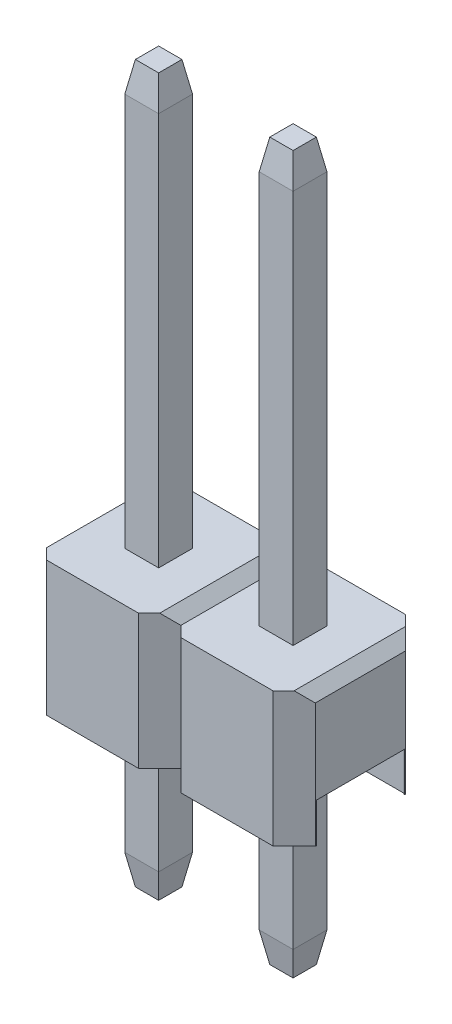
ISO-10303-21;
HEADER;
FILE_DESCRIPTION(('STEP AP214'),'2;1');
FILE_NAME('part.step','',(''),(''),'','','');
FILE_SCHEMA(('AUTOMOTIVE_DESIGN { 1 0 10303 214 1 1 1 1 }'));
ENDSEC;
DATA;
#1=APPLICATION_CONTEXT('core data for automotive mechanical design processes');
#2=APPLICATION_PROTOCOL_DEFINITION('international standard','automotive_design',2000,#1);
#3=PRODUCT_CONTEXT('',#1,'mechanical');
#4=PRODUCT('Part','Part','',(#3));
#5=PRODUCT_RELATED_PRODUCT_CATEGORY('part','',(#4));
#6=PRODUCT_DEFINITION_FORMATION('','',#4);
#7=PRODUCT_DEFINITION_CONTEXT('part definition',#1,'design');
#8=PRODUCT_DEFINITION('design','',#6,#7);
#9=PRODUCT_DEFINITION_SHAPE('','',#8);
#10=(LENGTH_UNIT() NAMED_UNIT(*) SI_UNIT(.MILLI.,.METRE.));
#11=(NAMED_UNIT(*) PLANE_ANGLE_UNIT() SI_UNIT($,.RADIAN.));
#12=(NAMED_UNIT(*) SI_UNIT($,.STERADIAN.) SOLID_ANGLE_UNIT());
#13=UNCERTAINTY_MEASURE_WITH_UNIT(LENGTH_MEASURE(1.E-05),#10,'distance_accuracy_value','');
#14=(GEOMETRIC_REPRESENTATION_CONTEXT(3) GLOBAL_UNCERTAINTY_ASSIGNED_CONTEXT((#13)) GLOBAL_UNIT_ASSIGNED_CONTEXT((#10,
#11,#12)) REPRESENTATION_CONTEXT('',''));
#15=CARTESIAN_POINT('',(0.,0.,0.));
#16=DIRECTION('',(0.,0.,1.));
#17=DIRECTION('',(1.,0.,0.));
#18=AXIS2_PLACEMENT_3D('',#15,#16,#17);
#19=CARTESIAN_POINT('',(3.815,0.,0.));
#20=DIRECTION('',(1.,0.,0.));
#21=DIRECTION('',(0.,0.,-1.));
#22=AXIS2_PLACEMENT_3D('',#19,#20,#21);
#23=PLANE('',#22);
#24=DIRECTION('',(0.,0.,-1.));
#25=VECTOR('',#24,1.);
#26=CARTESIAN_POINT('',(3.815,0.74,-0.83));
#27=LINE('',#26,#25);
#28=CARTESIAN_POINT('',(3.815,0.74,-0.85));
#29=VERTEX_POINT('',#28);
#30=CARTESIAN_POINT('',(3.815,0.74,-0.83));
#31=VERTEX_POINT('',#30);
#32=EDGE_CURVE('P0_E356',#29,#31,#27,.F.);
#33=ORIENTED_EDGE('',*,*,#32,.T.);
#34=DIRECTION('',(0.,1.,0.));
#35=VECTOR('',#34,1.);
#36=CARTESIAN_POINT('',(3.815,0.,-0.83));
#37=LINE('',#36,#35);
#38=CARTESIAN_POINT('',(3.815,0.,-0.83));
#39=VERTEX_POINT('',#38);
#40=EDGE_CURVE('P0_E346',#31,#39,#37,.F.);
#41=ORIENTED_EDGE('',*,*,#40,.T.);
#42=DIRECTION('',(0.,0.,-1.));
#43=VECTOR('',#42,1.);
#44=CARTESIAN_POINT('',(3.815,0.,0.));
#45=LINE('',#44,#43);
#46=CARTESIAN_POINT('',(3.815,0.,-0.85));
#47=VERTEX_POINT('',#46);
#48=EDGE_CURVE('P0_E20',#39,#47,#45,.T.);
#49=ORIENTED_EDGE('',*,*,#48,.T.);
#50=DIRECTION('',(0.,1.,0.));
#51=VECTOR('',#50,1.);
#52=CARTESIAN_POINT('',(3.815,0.,-0.85));
#53=LINE('',#52,#51);
#54=EDGE_CURVE('P0_E384',#47,#29,#53,.T.);
#55=ORIENTED_EDGE('',*,*,#54,.T.);
#56=EDGE_LOOP('',(#33,#41,#49,#55));
#57=FACE_BOUND('',#56,.T.);
#58=ADVANCED_FACE('P0_F17',(#57),#23,.T.);
#59=CARTESIAN_POINT('',(3.815,0.,-0.83));
#60=DIRECTION('',(0.,0.,-1.));
#61=DIRECTION('',(-1.,0.,0.));
#62=AXIS2_PLACEMENT_3D('',#59,#60,#61);
#63=PLANE('',#62);
#64=DIRECTION('',(0.707106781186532,0.707106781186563,0.));
#65=VECTOR('',#64,1.);
#66=CARTESIAN_POINT('',(3.805,0.735,-0.83));
#67=LINE('',#66,#65);
#68=CARTESIAN_POINT('',(3.805,0.735,-0.83));
#69=VERTEX_POINT('',#68);
#70=CARTESIAN_POINT('',(3.81,0.74,-0.83));
#71=VERTEX_POINT('',#70);
#72=EDGE_CURVE('P0_E353',#69,#71,#67,.T.);
#73=ORIENTED_EDGE('',*,*,#72,.F.);
#74=DIRECTION('',(0.,1.,0.));
#75=VECTOR('',#74,1.);
#76=CARTESIAN_POINT('',(3.805,0.,-0.83));
#77=LINE('',#76,#75);
#78=CARTESIAN_POINT('',(3.805,0.,-0.83));
#79=VERTEX_POINT('',#78);
#80=EDGE_CURVE('P0_E352',#69,#79,#77,.F.);
#81=ORIENTED_EDGE('',*,*,#80,.T.);
#82=DIRECTION('',(-1.,0.,0.));
#83=VECTOR('',#82,1.);
#84=CARTESIAN_POINT('',(3.815,0.,-0.83));
#85=LINE('',#84,#83);
#86=EDGE_CURVE('P0_E338',#39,#79,#85,.T.);
#87=ORIENTED_EDGE('',*,*,#86,.F.);
#88=ORIENTED_EDGE('',*,*,#40,.F.);
#89=DIRECTION('',(1.,0.,0.));
#90=VECTOR('',#89,1.);
#91=CARTESIAN_POINT('',(3.815,0.74,-0.83));
#92=LINE('',#91,#90);
#93=EDGE_CURVE('P0_E368',#31,#71,#92,.F.);
#94=ORIENTED_EDGE('',*,*,#93,.T.);
#95=EDGE_LOOP('',(#73,#81,#87,#88,#94));
#96=FACE_BOUND('',#95,.T.);
#97=ADVANCED_FACE('P0_F348',(#96),#63,.F.);
#98=CARTESIAN_POINT('',(3.815,0.74,0.83));
#99=DIRECTION('',(0.,0.,1.));
#100=DIRECTION('',(1.,0.,0.));
#101=AXIS2_PLACEMENT_3D('',#98,#99,#100);
#102=PLANE('',#101);
#103=DIRECTION('',(-0.707106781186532,-0.707106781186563,0.));
#104=VECTOR('',#103,1.);
#105=CARTESIAN_POINT('',(3.81,0.74,0.83));
#106=LINE('',#105,#104);
#107=CARTESIAN_POINT('',(3.81,0.74,0.83));
#108=VERTEX_POINT('',#107);
#109=CARTESIAN_POINT('',(3.805,0.735,0.83));
#110=VERTEX_POINT('',#109);
#111=EDGE_CURVE('P0_E360',#108,#110,#106,.T.);
#112=ORIENTED_EDGE('',*,*,#111,.F.);
#113=DIRECTION('',(1.,0.,0.));
#114=VECTOR('',#113,1.);
#115=CARTESIAN_POINT('',(3.815,0.74,0.83));
#116=LINE('',#115,#114);
#117=CARTESIAN_POINT('',(3.815,0.74,0.83));
#118=VERTEX_POINT('',#117);
#119=EDGE_CURVE('P0_E373',#108,#118,#116,.T.);
#120=ORIENTED_EDGE('',*,*,#119,.T.);
#121=DIRECTION('',(0.,1.,0.));
#122=VECTOR('',#121,1.);
#123=CARTESIAN_POINT('',(3.815,0.,0.83));
#124=LINE('',#123,#122);
#125=CARTESIAN_POINT('',(3.815,0.,0.83));
#126=VERTEX_POINT('',#125);
#127=EDGE_CURVE('P0_E362',#118,#126,#124,.F.);
#128=ORIENTED_EDGE('',*,*,#127,.T.);
#129=DIRECTION('',(1.,0.,0.));
#130=VECTOR('',#129,1.);
#131=CARTESIAN_POINT('',(3.815,0.,0.83));
#132=LINE('',#131,#130);
#133=CARTESIAN_POINT('',(3.805,0.,0.83));
#134=VERTEX_POINT('',#133);
#135=EDGE_CURVE('P0_E329',#134,#126,#132,.T.);
#136=ORIENTED_EDGE('',*,*,#135,.F.);
#137=DIRECTION('',(0.,1.,0.));
#138=VECTOR('',#137,1.);
#139=CARTESIAN_POINT('',(3.805,0.,0.83));
#140=LINE('',#139,#138);
#141=EDGE_CURVE('P0_E398',#110,#134,#140,.F.);
#142=ORIENTED_EDGE('',*,*,#141,.F.);
#143=EDGE_LOOP('',(#112,#120,#128,#136,#142));
#144=FACE_BOUND('',#143,.T.);
#145=ADVANCED_FACE('P0_F967',(#144),#102,.F.);
#146=CARTESIAN_POINT('',(3.815,0.,0.));
#147=DIRECTION('',(-1.,0.,0.));
#148=DIRECTION('',(0.,0.,1.));
#149=AXIS2_PLACEMENT_3D('',#146,#147,#148);
#150=PLANE('',#149);
#151=DIRECTION('',(0.,1.,0.));
#152=VECTOR('',#151,1.);
#153=CARTESIAN_POINT('',(3.815,0.74,0.85));
#154=LINE('',#153,#152);
#155=CARTESIAN_POINT('',(3.815,0.74,0.85));
#156=VERTEX_POINT('',#155);
#157=CARTESIAN_POINT('',(3.815,0.,0.85));
#158=VERTEX_POINT('',#157);
#159=EDGE_CURVE('P0_E415',#156,#158,#154,.F.);
#160=ORIENTED_EDGE('',*,*,#159,.T.);
#161=DIRECTION('',(0.,0.,1.));
#162=VECTOR('',#161,1.);
#163=CARTESIAN_POINT('',(3.815,0.,0.));
#164=LINE('',#163,#162);
#165=EDGE_CURVE('P0_E365',#126,#158,#164,.T.);
#166=ORIENTED_EDGE('',*,*,#165,.F.);
#167=ORIENTED_EDGE('',*,*,#127,.F.);
#168=DIRECTION('',(0.,0.,-1.));
#169=VECTOR('',#168,1.);
#170=CARTESIAN_POINT('',(3.815,0.74,0.85));
#171=LINE('',#170,#169);
#172=EDGE_CURVE('P0_E370',#118,#156,#171,.F.);
#173=ORIENTED_EDGE('',*,*,#172,.T.);
#174=EDGE_LOOP('',(#160,#166,#167,#173));
#175=FACE_BOUND('',#174,.T.);
#176=ADVANCED_FACE('P0_F963',(#175),#150,.F.);
#177=CARTESIAN_POINT('',(3.815,0.74,-0.83));
#178=DIRECTION('',(0.,-1.,0.));
#179=DIRECTION('',(0.,0.,-1.));
#180=AXIS2_PLACEMENT_3D('',#177,#178,#179);
#181=PLANE('',#180);
#182=DIRECTION('',(0.,0.,1.));
#183=VECTOR('',#182,1.);
#184=CARTESIAN_POINT('',(3.81,0.74,0.85));
#185=LINE('',#184,#183);
#186=CARTESIAN_POINT('',(3.81,0.74,-0.85));
#187=VERTEX_POINT('',#186);
#188=EDGE_CURVE('P0_E423',#187,#71,#185,.T.);
#189=ORIENTED_EDGE('',*,*,#188,.T.);
#190=ORIENTED_EDGE('',*,*,#93,.F.);
#191=ORIENTED_EDGE('',*,*,#32,.F.);
#192=DIRECTION('',(1.,0.,0.));
#193=VECTOR('',#192,1.);
#194=CARTESIAN_POINT('',(3.815,0.74,-0.85));
#195=LINE('',#194,#193);
#196=EDGE_CURVE('P0_E386',#29,#187,#195,.F.);
#197=ORIENTED_EDGE('',*,*,#196,.T.);
#198=EDGE_LOOP('',(#189,#190,#191,#197));
#199=FACE_BOUND('',#198,.T.);
#200=ADVANCED_FACE('P0_F959',(#199),#181,.F.);
#201=CARTESIAN_POINT('',(3.815,0.74,0.85));
#202=DIRECTION('',(0.,-1.,0.));
#203=DIRECTION('',(0.,0.,-1.));
#204=AXIS2_PLACEMENT_3D('',#201,#202,#203);
#205=PLANE('',#204);
#206=DIRECTION('',(0.,0.,1.));
#207=VECTOR('',#206,1.);
#208=CARTESIAN_POINT('',(3.81,0.74,0.85));
#209=LINE('',#208,#207);
#210=CARTESIAN_POINT('',(3.81,0.74,0.85));
#211=VERTEX_POINT('',#210);
#212=EDGE_CURVE('P0_E429',#108,#211,#209,.T.);
#213=ORIENTED_EDGE('',*,*,#212,.T.);
#214=DIRECTION('',(-1.,0.,0.));
#215=VECTOR('',#214,1.);
#216=CARTESIAN_POINT('',(3.815,0.74,0.85));
#217=LINE('',#216,#215);
#218=EDGE_CURVE('P0_E420',#211,#156,#217,.F.);
#219=ORIENTED_EDGE('',*,*,#218,.T.);
#220=ORIENTED_EDGE('',*,*,#172,.F.);
#221=ORIENTED_EDGE('',*,*,#119,.F.);
#222=EDGE_LOOP('',(#213,#219,#220,#221));
#223=FACE_BOUND('',#222,.T.);
#224=ADVANCED_FACE('P0_F955',(#223),#205,.F.);
#225=CARTESIAN_POINT('',(1.275,0.74,0.83));
#226=DIRECTION('',(0.,0.,1.));
#227=DIRECTION('',(1.,0.,0.));
#228=AXIS2_PLACEMENT_3D('',#225,#226,#227);
#229=PLANE('',#228);
#230=DIRECTION('',(0.,1.,0.));
#231=VECTOR('',#230,1.);
#232=CARTESIAN_POINT('',(1.275,0.,0.83));
#233=LINE('',#232,#231);
#234=CARTESIAN_POINT('',(1.275,0.735,0.83));
#235=VERTEX_POINT('',#234);
#236=CARTESIAN_POINT('',(1.275,0.,0.83));
#237=VERTEX_POINT('',#236);
#238=EDGE_CURVE('P0_E410',#235,#237,#233,.F.);
#239=ORIENTED_EDGE('',*,*,#238,.T.);
#240=DIRECTION('',(1.,0.,0.));
#241=VECTOR('',#240,1.);
#242=CARTESIAN_POINT('',(1.275,0.,0.83));
#243=LINE('',#242,#241);
#244=CARTESIAN_POINT('',(1.265,0.,0.83));
#245=VERTEX_POINT('',#244);
#246=EDGE_CURVE('P0_E378',#245,#237,#243,.T.);
#247=ORIENTED_EDGE('',*,*,#246,.F.);
#248=DIRECTION('',(0.,1.,0.));
#249=VECTOR('',#248,1.);
#250=CARTESIAN_POINT('',(1.265,0.,0.83));
#251=LINE('',#250,#249);
#252=CARTESIAN_POINT('',(1.265,0.735,0.83));
#253=VERTEX_POINT('',#252);
#254=EDGE_CURVE('P0_E464',#253,#245,#251,.F.);
#255=ORIENTED_EDGE('',*,*,#254,.F.);
#256=DIRECTION('',(-0.707106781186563,-0.707106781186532,0.));
#257=VECTOR('',#256,1.);
#258=CARTESIAN_POINT('',(1.27,0.74,0.83));
#259=LINE('',#258,#257);
#260=CARTESIAN_POINT('',(1.27,0.74,0.830000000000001));
#261=VERTEX_POINT('',#260);
#262=EDGE_CURVE('P0_E376',#261,#253,#259,.T.);
#263=ORIENTED_EDGE('',*,*,#262,.F.);
#264=DIRECTION('',(-0.707106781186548,0.707106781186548,0.));
#265=VECTOR('',#264,1.);
#266=CARTESIAN_POINT('',(1.47,0.54,0.830000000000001));
#267=LINE('',#266,#265);
#268=EDGE_CURVE('P0_E459',#261,#235,#267,.F.);
#269=ORIENTED_EDGE('',*,*,#268,.T.);
#270=EDGE_LOOP('',(#239,#247,#255,#263,#269));
#271=FACE_BOUND('',#270,.T.);
#272=ADVANCED_FACE('P0_F951',(#271),#229,.F.);
#273=CARTESIAN_POINT('',(1.275,0.,-0.83));
#274=DIRECTION('',(0.,0.,-1.));
#275=DIRECTION('',(-1.,0.,0.));
#276=AXIS2_PLACEMENT_3D('',#273,#274,#275);
#277=PLANE('',#276);
#278=DIRECTION('',(0.707106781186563,0.707106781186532,0.));
#279=VECTOR('',#278,1.);
#280=CARTESIAN_POINT('',(1.265,0.735,-0.83));
#281=LINE('',#280,#279);
#282=CARTESIAN_POINT('',(1.265,0.735,-0.83));
#283=VERTEX_POINT('',#282);
#284=CARTESIAN_POINT('',(1.27,0.74,-0.83));
#285=VERTEX_POINT('',#284);
#286=EDGE_CURVE('P0_E382',#283,#285,#281,.T.);
#287=ORIENTED_EDGE('',*,*,#286,.F.);
#288=DIRECTION('',(0.,1.,0.));
#289=VECTOR('',#288,1.);
#290=CARTESIAN_POINT('',(1.265,0.,-0.83));
#291=LINE('',#290,#289);
#292=CARTESIAN_POINT('',(1.265,0.,-0.83));
#293=VERTEX_POINT('',#292);
#294=EDGE_CURVE('P0_E471',#283,#293,#291,.F.);
#295=ORIENTED_EDGE('',*,*,#294,.T.);
#296=DIRECTION('',(-1.,0.,0.));
#297=VECTOR('',#296,1.);
#298=CARTESIAN_POINT('',(1.275,0.,-0.83));
#299=LINE('',#298,#297);
#300=CARTESIAN_POINT('',(1.275,0.,-0.83));
#301=VERTEX_POINT('',#300);
#302=EDGE_CURVE('P0_E380',#301,#293,#299,.T.);
#303=ORIENTED_EDGE('',*,*,#302,.F.);
#304=DIRECTION('',(0.,1.,0.));
#305=VECTOR('',#304,1.);
#306=CARTESIAN_POINT('',(1.275,0.,-0.83));
#307=LINE('',#306,#305);
#308=CARTESIAN_POINT('',(1.275,0.735,-0.83));
#309=VERTEX_POINT('',#308);
#310=EDGE_CURVE('P0_E393',#309,#301,#307,.F.);
#311=ORIENTED_EDGE('',*,*,#310,.F.);
#312=DIRECTION('',(-0.707106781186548,0.707106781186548,0.));
#313=VECTOR('',#312,1.);
#314=CARTESIAN_POINT('',(1.47,0.54,-0.83));
#315=LINE('',#314,#313);
#316=EDGE_CURVE('P0_E456',#309,#285,#315,.T.);
#317=ORIENTED_EDGE('',*,*,#316,.T.);
#318=EDGE_LOOP('',(#287,#295,#303,#311,#317));
#319=FACE_BOUND('',#318,.T.);
#320=ADVANCED_FACE('P0_F947',(#319),#277,.F.);
#321=CARTESIAN_POINT('',(3.815,0.,-0.85));
#322=DIRECTION('',(0.,0.,1.));
#323=DIRECTION('',(1.,0.,0.));
#324=AXIS2_PLACEMENT_3D('',#321,#322,#323);
#325=PLANE('',#324);
#326=DIRECTION('',(0.,1.,0.));
#327=VECTOR('',#326,1.);
#328=CARTESIAN_POINT('',(3.81,2.54,-0.85));
#329=LINE('',#328,#327);
#330=CARTESIAN_POINT('',(3.81,0.,-0.85));
#331=VERTEX_POINT('',#330);
#332=EDGE_CURVE('P0_E474',#331,#187,#329,.T.);
#333=ORIENTED_EDGE('',*,*,#332,.T.);
#334=ORIENTED_EDGE('',*,*,#196,.F.);
#335=ORIENTED_EDGE('',*,*,#54,.F.);
#336=DIRECTION('',(1.,0.,0.));
#337=VECTOR('',#336,1.);
#338=CARTESIAN_POINT('',(3.815,0.,-0.85));
#339=LINE('',#338,#337);
#340=EDGE_CURVE('P0_E341',#331,#47,#339,.T.);
#341=ORIENTED_EDGE('',*,*,#340,.F.);
#342=EDGE_LOOP('',(#333,#334,#335,#341));
#343=FACE_BOUND('',#342,.T.);
#344=ADVANCED_FACE('P0_F943',(#343),#325,.F.);
#345=CARTESIAN_POINT('',(3.805,0.,0.));
#346=DIRECTION('',(1.,0.,0.));
#347=DIRECTION('',(0.,0.,-1.));
#348=AXIS2_PLACEMENT_3D('',#345,#346,#347);
#349=PLANE('',#348);
#350=DIRECTION('',(0.,0.,1.));
#351=VECTOR('',#350,1.);
#352=CARTESIAN_POINT('',(3.805,0.735,-0.85));
#353=LINE('',#352,#351);
#354=CARTESIAN_POINT('',(3.805,0.735,-0.85));
#355=VERTEX_POINT('',#354);
#356=EDGE_CURVE('P0_E403',#69,#355,#353,.F.);
#357=ORIENTED_EDGE('',*,*,#356,.T.);
#358=DIRECTION('',(0.,1.,0.));
#359=VECTOR('',#358,1.);
#360=CARTESIAN_POINT('',(3.805,0.,-0.85));
#361=LINE('',#360,#359);
#362=CARTESIAN_POINT('',(3.805,0.,-0.85));
#363=VERTEX_POINT('',#362);
#364=EDGE_CURVE('P0_E491',#355,#363,#361,.F.);
#365=ORIENTED_EDGE('',*,*,#364,.T.);
#366=DIRECTION('',(0.,0.,-1.));
#367=VECTOR('',#366,1.);
#368=CARTESIAN_POINT('',(3.805,0.,0.));
#369=LINE('',#368,#367);
#370=EDGE_CURVE('P0_E390',#79,#363,#369,.T.);
#371=ORIENTED_EDGE('',*,*,#370,.F.);
#372=ORIENTED_EDGE('',*,*,#80,.F.);
#373=EDGE_LOOP('',(#357,#365,#371,#372));
#374=FACE_BOUND('',#373,.T.);
#375=ADVANCED_FACE('P0_F939',(#374),#349,.F.);
#376=CARTESIAN_POINT('',(1.275,0.,0.));
#377=DIRECTION('',(1.,0.,0.));
#378=DIRECTION('',(0.,0.,-1.));
#379=AXIS2_PLACEMENT_3D('',#376,#377,#378);
#380=PLANE('',#379);
#381=ORIENTED_EDGE('',*,*,#310,.T.);
#382=DIRECTION('',(0.,0.,-1.));
#383=VECTOR('',#382,1.);
#384=CARTESIAN_POINT('',(1.275,0.,0.));
#385=LINE('',#384,#383);
#386=CARTESIAN_POINT('',(1.275,0.,-0.85));
#387=VERTEX_POINT('',#386);
#388=EDGE_CURVE('P0_E396',#301,#387,#385,.T.);
#389=ORIENTED_EDGE('',*,*,#388,.T.);
#390=DIRECTION('',(0.,1.,0.));
#391=VECTOR('',#390,1.);
#392=CARTESIAN_POINT('',(1.275,0.,-0.85));
#393=LINE('',#392,#391);
#394=CARTESIAN_POINT('',(1.275,0.735,-0.85));
#395=VERTEX_POINT('',#394);
#396=EDGE_CURVE('P0_E494',#387,#395,#393,.T.);
#397=ORIENTED_EDGE('',*,*,#396,.T.);
#398=DIRECTION('',(0.,0.,1.));
#399=VECTOR('',#398,1.);
#400=CARTESIAN_POINT('',(1.275,0.735,-0.85));
#401=LINE('',#400,#399);
#402=EDGE_CURVE('P0_E453',#395,#309,#401,.T.);
#403=ORIENTED_EDGE('',*,*,#402,.T.);
#404=EDGE_LOOP('',(#381,#389,#397,#403));
#405=FACE_BOUND('',#404,.T.);
#406=ADVANCED_FACE('P0_F935',(#405),#380,.T.);
#407=CARTESIAN_POINT('',(3.805,0.,0.));
#408=DIRECTION('',(-1.,0.,0.));
#409=DIRECTION('',(0.,0.,1.));
#410=AXIS2_PLACEMENT_3D('',#407,#408,#409);
#411=PLANE('',#410);
#412=DIRECTION('',(0.,0.,1.));
#413=VECTOR('',#412,1.);
#414=CARTESIAN_POINT('',(3.805,0.,0.));
#415=LINE('',#414,#413);
#416=CARTESIAN_POINT('',(3.805,0.,0.85));
#417=VERTEX_POINT('',#416);
#418=EDGE_CURVE('P0_E401',#134,#417,#415,.T.);
#419=ORIENTED_EDGE('',*,*,#418,.T.);
#420=DIRECTION('',(0.,1.,0.));
#421=VECTOR('',#420,1.);
#422=CARTESIAN_POINT('',(3.805,0.,0.85));
#423=LINE('',#422,#421);
#424=CARTESIAN_POINT('',(3.805,0.735,0.85));
#425=VERTEX_POINT('',#424);
#426=EDGE_CURVE('P0_E499',#417,#425,#423,.T.);
#427=ORIENTED_EDGE('',*,*,#426,.T.);
#428=DIRECTION('',(0.,0.,1.));
#429=VECTOR('',#428,1.);
#430=CARTESIAN_POINT('',(3.805,0.735,-0.85));
#431=LINE('',#430,#429);
#432=EDGE_CURVE('P0_E405',#425,#110,#431,.F.);
#433=ORIENTED_EDGE('',*,*,#432,.T.);
#434=ORIENTED_EDGE('',*,*,#141,.T.);
#435=EDGE_LOOP('',(#419,#427,#433,#434));
#436=FACE_BOUND('',#435,.T.);
#437=ADVANCED_FACE('P0_F931',(#436),#411,.T.);
#438=CARTESIAN_POINT('',(3.61,0.54,-0.85));
#439=DIRECTION('',(-0.707106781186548,0.707106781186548,0.));
#440=DIRECTION('',(-0.707106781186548,-0.707106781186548,0.));
#441=AXIS2_PLACEMENT_3D('',#438,#439,#440);
#442=PLANE('',#441);
#443=DIRECTION('',(0.,0.,1.));
#444=VECTOR('',#443,1.);
#445=CARTESIAN_POINT('',(3.81,0.74,0.85));
#446=LINE('',#445,#444);
#447=EDGE_CURVE('P0_E426',#71,#108,#446,.T.);
#448=ORIENTED_EDGE('',*,*,#447,.T.);
#449=ORIENTED_EDGE('',*,*,#111,.T.);
#450=ORIENTED_EDGE('',*,*,#432,.F.);
#451=DIRECTION('',(-0.707106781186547,-0.707106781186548,0.));
#452=VECTOR('',#451,1.);
#453=CARTESIAN_POINT('',(3.805,0.735,0.85));
#454=LINE('',#453,#452);
#455=CARTESIAN_POINT('',(3.61,0.54,0.850000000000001));
#456=VERTEX_POINT('',#455);
#457=EDGE_CURVE('P0_E502',#425,#456,#454,.T.);
#458=ORIENTED_EDGE('',*,*,#457,.T.);
#459=DIRECTION('',(0.,0.,1.));
#460=VECTOR('',#459,1.);
#461=CARTESIAN_POINT('',(3.61,0.54,0.85));
#462=LINE('',#461,#460);
#463=CARTESIAN_POINT('',(3.61,0.54,-0.85));
#464=VERTEX_POINT('',#463);
#465=EDGE_CURVE('P0_E408',#456,#464,#462,.F.);
#466=ORIENTED_EDGE('',*,*,#465,.T.);
#467=DIRECTION('',(0.707106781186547,0.707106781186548,0.));
#468=VECTOR('',#467,1.);
#469=CARTESIAN_POINT('',(3.61,0.54,-0.85));
#470=LINE('',#469,#468);
#471=EDGE_CURVE('P0_E488',#464,#355,#470,.T.);
#472=ORIENTED_EDGE('',*,*,#471,.T.);
#473=ORIENTED_EDGE('',*,*,#356,.F.);
#474=ORIENTED_EDGE('',*,*,#72,.T.);
#475=EDGE_LOOP('',(#448,#449,#450,#458,#466,#472,#473,#474));
#476=FACE_BOUND('',#475,.T.);
#477=ADVANCED_FACE('P0_F927',(#476),#442,.F.);
#478=CARTESIAN_POINT('',(1.27,0.54,0.85));
#479=DIRECTION('',(0.,1.,0.));
#480=DIRECTION('',(0.,0.,1.));
#481=AXIS2_PLACEMENT_3D('',#478,#479,#480);
#482=PLANE('',#481);
#483=ORIENTED_EDGE('',*,*,#465,.F.);
#484=DIRECTION('',(1.,0.,0.));
#485=VECTOR('',#484,1.);
#486=CARTESIAN_POINT('',(1.27,0.54,0.85));
#487=LINE('',#486,#485);
#488=CARTESIAN_POINT('',(1.47,0.54,0.85));
#489=VERTEX_POINT('',#488);
#490=EDGE_CURVE('P0_E505',#456,#489,#487,.F.);
#491=ORIENTED_EDGE('',*,*,#490,.T.);
#492=DIRECTION('',(0.,0.,1.));
#493=VECTOR('',#492,1.);
#494=CARTESIAN_POINT('',(1.47,0.54,-0.85));
#495=LINE('',#494,#493);
#496=CARTESIAN_POINT('',(1.47,0.54,-0.85));
#497=VERTEX_POINT('',#496);
#498=EDGE_CURVE('P0_E451',#489,#497,#495,.F.);
#499=ORIENTED_EDGE('',*,*,#498,.T.);
#500=DIRECTION('',(-1.,0.,0.));
#501=VECTOR('',#500,1.);
#502=CARTESIAN_POINT('',(1.27,0.54,-0.85));
#503=LINE('',#502,#501);
#504=EDGE_CURVE('P0_E485',#497,#464,#503,.F.);
#505=ORIENTED_EDGE('',*,*,#504,.T.);
#506=EDGE_LOOP('',(#483,#491,#499,#505));
#507=FACE_BOUND('',#506,.T.);
#508=DIRECTION('',(1.,0.,0.));
#509=VECTOR('',#508,1.);
#510=CARTESIAN_POINT('',(2.22,0.54,-0.32));
#511=LINE('',#510,#509);
#512=CARTESIAN_POINT('',(2.22,0.54,-0.32));
#513=VERTEX_POINT('',#512);
#514=CARTESIAN_POINT('',(2.86,0.54,-0.32));
#515=VERTEX_POINT('',#514);
#516=EDGE_CURVE('P0_E434',#513,#515,#511,.T.);
#517=ORIENTED_EDGE('',*,*,#516,.F.);
#518=DIRECTION('',(0.,0.,-1.));
#519=VECTOR('',#518,1.);
#520=CARTESIAN_POINT('',(2.22,0.54,0.32));
#521=LINE('',#520,#519);
#522=CARTESIAN_POINT('',(2.22,0.54,0.32));
#523=VERTEX_POINT('',#522);
#524=EDGE_CURVE('P0_E436',#523,#513,#521,.T.);
#525=ORIENTED_EDGE('',*,*,#524,.F.);
#526=DIRECTION('',(-1.,0.,0.));
#527=VECTOR('',#526,1.);
#528=CARTESIAN_POINT('',(2.22,0.54,0.32));
#529=LINE('',#528,#527);
#530=CARTESIAN_POINT('',(2.86,0.54,0.32));
#531=VERTEX_POINT('',#530);
#532=EDGE_CURVE('P0_E440',#531,#523,#529,.T.);
#533=ORIENTED_EDGE('',*,*,#532,.F.);
#534=DIRECTION('',(0.,0.,1.));
#535=VECTOR('',#534,1.);
#536=CARTESIAN_POINT('',(2.86,0.54,0.32));
#537=LINE('',#536,#535);
#538=EDGE_CURVE('P0_E444',#515,#531,#537,.T.);
#539=ORIENTED_EDGE('',*,*,#538,.F.);
#540=EDGE_LOOP('',(#517,#525,#533,#539));
#541=FACE_BOUND('',#540,.T.);
#542=ADVANCED_FACE('P0_F923',(#507,#541),#482,.F.);
#543=CARTESIAN_POINT('',(1.275,0.,0.));
#544=DIRECTION('',(-1.,0.,0.));
#545=DIRECTION('',(0.,0.,1.));
#546=AXIS2_PLACEMENT_3D('',#543,#544,#545);
#547=PLANE('',#546);
#548=DIRECTION('',(0.,1.,0.));
#549=VECTOR('',#548,1.);
#550=CARTESIAN_POINT('',(1.275,0.,0.85));
#551=LINE('',#550,#549);
#552=CARTESIAN_POINT('',(1.275,0.735,0.850000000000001));
#553=VERTEX_POINT('',#552);
#554=CARTESIAN_POINT('',(1.275,0.,0.85));
#555=VERTEX_POINT('',#554);
#556=EDGE_CURVE('P0_E511',#553,#555,#551,.F.);
#557=ORIENTED_EDGE('',*,*,#556,.T.);
#558=DIRECTION('',(0.,0.,1.));
#559=VECTOR('',#558,1.);
#560=CARTESIAN_POINT('',(1.275,0.,0.));
#561=LINE('',#560,#559);
#562=EDGE_CURVE('P0_E413',#237,#555,#561,.T.);
#563=ORIENTED_EDGE('',*,*,#562,.F.);
#564=ORIENTED_EDGE('',*,*,#238,.F.);
#565=DIRECTION('',(0.,0.,1.));
#566=VECTOR('',#565,1.);
#567=CARTESIAN_POINT('',(1.275,0.735,-0.85));
#568=LINE('',#567,#566);
#569=EDGE_CURVE('P0_E462',#235,#553,#568,.T.);
#570=ORIENTED_EDGE('',*,*,#569,.T.);
#571=EDGE_LOOP('',(#557,#563,#564,#570));
#572=FACE_BOUND('',#571,.T.);
#573=ADVANCED_FACE('P0_F919',(#572),#547,.F.);
#574=CARTESIAN_POINT('',(3.815,0.74,0.85));
#575=DIRECTION('',(0.,0.,-1.));
#576=DIRECTION('',(-1.,0.,0.));
#577=AXIS2_PLACEMENT_3D('',#574,#575,#576);
#578=PLANE('',#577);
#579=DIRECTION('',(0.,1.,0.));
#580=VECTOR('',#579,1.);
#581=CARTESIAN_POINT('',(3.81,2.54,0.85));
#582=LINE('',#581,#580);
#583=CARTESIAN_POINT('',(3.81,0.,0.85));
#584=VERTEX_POINT('',#583);
#585=EDGE_CURVE('P0_E514',#211,#584,#582,.F.);
#586=ORIENTED_EDGE('',*,*,#585,.T.);
#587=DIRECTION('',(-1.,0.,0.));
#588=VECTOR('',#587,1.);
#589=CARTESIAN_POINT('',(3.815,0.,0.85));
#590=LINE('',#589,#588);
#591=EDGE_CURVE('P0_E418',#158,#584,#590,.T.);
#592=ORIENTED_EDGE('',*,*,#591,.F.);
#593=ORIENTED_EDGE('',*,*,#159,.F.);
#594=ORIENTED_EDGE('',*,*,#218,.F.);
#595=EDGE_LOOP('',(#586,#592,#593,#594));
#596=FACE_BOUND('',#595,.T.);
#597=ADVANCED_FACE('P0_F915',(#596),#578,.F.);
#598=CARTESIAN_POINT('',(3.81,2.54,0.85));
#599=DIRECTION('',(-1.,0.,0.));
#600=DIRECTION('',(0.,0.,1.));
#601=AXIS2_PLACEMENT_3D('',#598,#599,#600);
#602=PLANE('',#601);
#603=DIRECTION('',(0.,0.,1.));
#604=VECTOR('',#603,1.);
#605=CARTESIAN_POINT('',(3.81,2.34,0.));
#606=LINE('',#605,#604);
#607=CARTESIAN_POINT('',(3.81,2.34,-0.85));
#608=VERTEX_POINT('',#607);
#609=CARTESIAN_POINT('',(3.81,2.34,0.85));
#610=VERTEX_POINT('',#609);
#611=EDGE_CURVE('P0_E432',#608,#610,#606,.T.);
#612=ORIENTED_EDGE('',*,*,#611,.T.);
#613=DIRECTION('',(0.,1.,0.));
#614=VECTOR('',#613,1.);
#615=CARTESIAN_POINT('',(3.81,2.54,0.85));
#616=LINE('',#615,#614);
#617=EDGE_CURVE('P0_E520',#610,#211,#616,.F.);
#618=ORIENTED_EDGE('',*,*,#617,.T.);
#619=ORIENTED_EDGE('',*,*,#212,.F.);
#620=ORIENTED_EDGE('',*,*,#447,.F.);
#621=ORIENTED_EDGE('',*,*,#188,.F.);
#622=DIRECTION('',(0.,1.,0.));
#623=VECTOR('',#622,1.);
#624=CARTESIAN_POINT('',(3.81,2.54,-0.85));
#625=LINE('',#624,#623);
#626=EDGE_CURVE('P0_E477',#187,#608,#625,.T.);
#627=ORIENTED_EDGE('',*,*,#626,.T.);
#628=EDGE_LOOP('',(#612,#618,#619,#620,#621,#627));
#629=FACE_BOUND('',#628,.T.);
#630=ADVANCED_FACE('P0_F911',(#629),#602,.F.);
#631=CARTESIAN_POINT('',(3.61,2.54,0.));
#632=DIRECTION('',(-0.707106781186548,-0.707106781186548,0.));
#633=DIRECTION('',(0.707106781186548,-0.707106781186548,0.));
#634=AXIS2_PLACEMENT_3D('',#631,#632,#633);
#635=PLANE('',#634);
#636=ORIENTED_EDGE('',*,*,#611,.F.);
#637=DIRECTION('',(-0.577350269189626,0.577350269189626,-0.577350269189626));
#638=VECTOR('',#637,1.);
#639=CARTESIAN_POINT('',(3.81,2.34,-0.85));
#640=LINE('',#639,#638);
#641=CARTESIAN_POINT('',(3.61,2.54,-1.05));
#642=VERTEX_POINT('',#641);
#643=EDGE_CURVE('P0_E480',#608,#642,#640,.T.);
#644=ORIENTED_EDGE('',*,*,#643,.T.);
#645=DIRECTION('',(0.,0.,-1.));
#646=VECTOR('',#645,1.);
#647=CARTESIAN_POINT('',(3.61,2.54,0.));
#648=LINE('',#647,#646);
#649=CARTESIAN_POINT('',(3.61,2.54,1.05));
#650=VERTEX_POINT('',#649);
#651=EDGE_CURVE('P0_E535',#642,#650,#648,.F.);
#652=ORIENTED_EDGE('',*,*,#651,.T.);
#653=DIRECTION('',(0.577350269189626,-0.577350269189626,-0.577350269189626));
#654=VECTOR('',#653,1.);
#655=CARTESIAN_POINT('',(3.61,2.54,1.05));
#656=LINE('',#655,#654);
#657=EDGE_CURVE('P0_E517',#650,#610,#656,.T.);
#658=ORIENTED_EDGE('',*,*,#657,.T.);
#659=EDGE_LOOP('',(#636,#644,#652,#658));
#660=FACE_BOUND('',#659,.T.);
#661=ADVANCED_FACE('P0_F907',(#660),#635,.F.);
#662=CARTESIAN_POINT('',(2.22,2.54,-0.32));
#663=DIRECTION('',(0.,0.,1.));
#664=DIRECTION('',(1.,0.,0.));
#665=AXIS2_PLACEMENT_3D('',#662,#663,#664);
#666=PLANE('',#665);
#667=DIRECTION('',(1.,0.,0.));
#668=VECTOR('',#667,1.);
#669=CARTESIAN_POINT('',(2.54,2.54,-0.32));
#670=LINE('',#669,#668);
#671=CARTESIAN_POINT('',(2.86,2.54,-0.32));
#672=VERTEX_POINT('',#671);
#673=CARTESIAN_POINT('',(2.22,2.54,-0.32));
#674=VERTEX_POINT('',#673);
#675=EDGE_CURVE('P0_E541',#672,#674,#670,.F.);
#676=ORIENTED_EDGE('',*,*,#675,.T.);
#677=DIRECTION('',(0.,1.,0.));
#678=VECTOR('',#677,1.);
#679=CARTESIAN_POINT('',(2.22,2.54,-0.32));
#680=LINE('',#679,#678);
#681=EDGE_CURVE('P0_E438',#513,#674,#680,.T.);
#682=ORIENTED_EDGE('',*,*,#681,.F.);
#683=ORIENTED_EDGE('',*,*,#516,.T.);
#684=DIRECTION('',(0.,1.,0.));
#685=VECTOR('',#684,1.);
#686=CARTESIAN_POINT('',(2.86,2.54,-0.32));
#687=LINE('',#686,#685);
#688=EDGE_CURVE('P0_E448',#672,#515,#687,.F.);
#689=ORIENTED_EDGE('',*,*,#688,.F.);
#690=EDGE_LOOP('',(#676,#682,#683,#689));
#691=FACE_BOUND('',#690,.T.);
#692=ADVANCED_FACE('P0_F903',(#691),#666,.T.);
#693=CARTESIAN_POINT('',(2.22,2.54,0.32));
#694=DIRECTION('',(1.,0.,0.));
#695=DIRECTION('',(0.,0.,-1.));
#696=AXIS2_PLACEMENT_3D('',#693,#694,#695);
#697=PLANE('',#696);
#698=DIRECTION('',(0.,0.,-1.));
#699=VECTOR('',#698,1.);
#700=CARTESIAN_POINT('',(2.22,2.54,0.));
#701=LINE('',#700,#699);
#702=CARTESIAN_POINT('',(2.22,2.54,0.32));
#703=VERTEX_POINT('',#702);
#704=EDGE_CURVE('P0_E544',#674,#703,#701,.F.);
#705=ORIENTED_EDGE('',*,*,#704,.T.);
#706=DIRECTION('',(0.,1.,0.));
#707=VECTOR('',#706,1.);
#708=CARTESIAN_POINT('',(2.22,2.54,0.32));
#709=LINE('',#708,#707);
#710=EDGE_CURVE('P0_E442',#523,#703,#709,.T.);
#711=ORIENTED_EDGE('',*,*,#710,.F.);
#712=ORIENTED_EDGE('',*,*,#524,.T.);
#713=ORIENTED_EDGE('',*,*,#681,.T.);
#714=EDGE_LOOP('',(#705,#711,#712,#713));
#715=FACE_BOUND('',#714,.T.);
#716=ADVANCED_FACE('P0_F899',(#715),#697,.T.);
#717=CARTESIAN_POINT('',(2.22,2.54,0.32));
#718=DIRECTION('',(0.,0.,-1.));
#719=DIRECTION('',(-1.,0.,0.));
#720=AXIS2_PLACEMENT_3D('',#717,#718,#719);
#721=PLANE('',#720);
#722=DIRECTION('',(1.,0.,0.));
#723=VECTOR('',#722,1.);
#724=CARTESIAN_POINT('',(2.54,2.54,0.32));
#725=LINE('',#724,#723);
#726=CARTESIAN_POINT('',(2.86,2.54,0.32));
#727=VERTEX_POINT('',#726);
#728=EDGE_CURVE('P0_E547',#703,#727,#725,.T.);
#729=ORIENTED_EDGE('',*,*,#728,.T.);
#730=DIRECTION('',(0.,1.,0.));
#731=VECTOR('',#730,1.);
#732=CARTESIAN_POINT('',(2.86,2.54,0.32));
#733=LINE('',#732,#731);
#734=EDGE_CURVE('P0_E446',#531,#727,#733,.T.);
#735=ORIENTED_EDGE('',*,*,#734,.F.);
#736=ORIENTED_EDGE('',*,*,#532,.T.);
#737=ORIENTED_EDGE('',*,*,#710,.T.);
#738=EDGE_LOOP('',(#729,#735,#736,#737));
#739=FACE_BOUND('',#738,.T.);
#740=ADVANCED_FACE('P0_F895',(#739),#721,.T.);
#741=CARTESIAN_POINT('',(2.86,2.54,0.32));
#742=DIRECTION('',(-1.,0.,0.));
#743=DIRECTION('',(0.,0.,1.));
#744=AXIS2_PLACEMENT_3D('',#741,#742,#743);
#745=PLANE('',#744);
#746=DIRECTION('',(0.,0.,-1.));
#747=VECTOR('',#746,1.);
#748=CARTESIAN_POINT('',(2.86,2.54,0.));
#749=LINE('',#748,#747);
#750=EDGE_CURVE('P0_E550',#727,#672,#749,.T.);
#751=ORIENTED_EDGE('',*,*,#750,.T.);
#752=ORIENTED_EDGE('',*,*,#688,.T.);
#753=ORIENTED_EDGE('',*,*,#538,.T.);
#754=ORIENTED_EDGE('',*,*,#734,.T.);
#755=EDGE_LOOP('',(#751,#752,#753,#754));
#756=FACE_BOUND('',#755,.T.);
#757=ADVANCED_FACE('P0_F891',(#756),#745,.T.);
#758=CARTESIAN_POINT('',(1.47,0.54,-0.85));
#759=DIRECTION('',(0.707106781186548,0.707106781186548,0.));
#760=DIRECTION('',(-0.707106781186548,0.707106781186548,0.));
#761=AXIS2_PLACEMENT_3D('',#758,#759,#760);
#762=PLANE('',#761);
#763=ORIENTED_EDGE('',*,*,#268,.F.);
#764=DIRECTION('',(0.,0.,1.));
#765=VECTOR('',#764,1.);
#766=CARTESIAN_POINT('',(1.27,0.74,-0.85));
#767=LINE('',#766,#765);
#768=EDGE_CURVE('P0_E558',#261,#285,#767,.F.);
#769=ORIENTED_EDGE('',*,*,#768,.T.);
#770=ORIENTED_EDGE('',*,*,#316,.F.);
#771=ORIENTED_EDGE('',*,*,#402,.F.);
#772=DIRECTION('',(0.707106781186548,-0.707106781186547,0.));
#773=VECTOR('',#772,1.);
#774=CARTESIAN_POINT('',(1.275,0.735,-0.85));
#775=LINE('',#774,#773);
#776=EDGE_CURVE('P0_E482',#395,#497,#775,.T.);
#777=ORIENTED_EDGE('',*,*,#776,.T.);
#778=ORIENTED_EDGE('',*,*,#498,.F.);
#779=DIRECTION('',(-0.707106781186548,0.707106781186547,0.));
#780=VECTOR('',#779,1.);
#781=CARTESIAN_POINT('',(1.47,0.54,0.85));
#782=LINE('',#781,#780);
#783=EDGE_CURVE('P0_E508',#489,#553,#782,.T.);
#784=ORIENTED_EDGE('',*,*,#783,.T.);
#785=ORIENTED_EDGE('',*,*,#569,.F.);
#786=EDGE_LOOP('',(#763,#769,#770,#771,#777,#778,#784,#785));
#787=FACE_BOUND('',#786,.T.);
#788=ADVANCED_FACE('P0_F887',(#787),#762,.F.);
#789=CARTESIAN_POINT('',(1.265,0.,0.));
#790=DIRECTION('',(-1.,0.,0.));
#791=DIRECTION('',(0.,0.,1.));
#792=AXIS2_PLACEMENT_3D('',#789,#790,#791);
#793=PLANE('',#792);
#794=DIRECTION('',(0.,0.,1.));
#795=VECTOR('',#794,1.);
#796=CARTESIAN_POINT('',(1.265,0.,0.));
#797=LINE('',#796,#795);
#798=CARTESIAN_POINT('',(1.265,0.,0.85));
#799=VERTEX_POINT('',#798);
#800=EDGE_CURVE('P0_E467',#245,#799,#797,.T.);
#801=ORIENTED_EDGE('',*,*,#800,.T.);
#802=DIRECTION('',(0.,1.,0.));
#803=VECTOR('',#802,1.);
#804=CARTESIAN_POINT('',(1.265,0.,0.85));
#805=LINE('',#804,#803);
#806=CARTESIAN_POINT('',(1.265,0.735,0.85));
#807=VERTEX_POINT('',#806);
#808=EDGE_CURVE('P0_E564',#799,#807,#805,.T.);
#809=ORIENTED_EDGE('',*,*,#808,.T.);
#810=DIRECTION('',(0.,0.,1.));
#811=VECTOR('',#810,1.);
#812=CARTESIAN_POINT('',(1.265,0.735,-0.85));
#813=LINE('',#812,#811);
#814=EDGE_CURVE('P0_E555',#807,#253,#813,.F.);
#815=ORIENTED_EDGE('',*,*,#814,.T.);
#816=ORIENTED_EDGE('',*,*,#254,.T.);
#817=EDGE_LOOP('',(#801,#809,#815,#816));
#818=FACE_BOUND('',#817,.T.);
#819=ADVANCED_FACE('P0_F883',(#818),#793,.T.);
#820=CARTESIAN_POINT('',(1.265,0.,0.));
#821=DIRECTION('',(1.,0.,0.));
#822=DIRECTION('',(0.,0.,-1.));
#823=AXIS2_PLACEMENT_3D('',#820,#821,#822);
#824=PLANE('',#823);
#825=DIRECTION('',(0.,0.,1.));
#826=VECTOR('',#825,1.);
#827=CARTESIAN_POINT('',(1.265,0.735,-0.85));
#828=LINE('',#827,#826);
#829=CARTESIAN_POINT('',(1.265,0.735,-0.85));
#830=VERTEX_POINT('',#829);
#831=EDGE_CURVE('P0_E553',#283,#830,#828,.F.);
#832=ORIENTED_EDGE('',*,*,#831,.T.);
#833=DIRECTION('',(0.,1.,0.));
#834=VECTOR('',#833,1.);
#835=CARTESIAN_POINT('',(1.265,0.,-0.85));
#836=LINE('',#835,#834);
#837=CARTESIAN_POINT('',(1.265,0.,-0.85));
#838=VERTEX_POINT('',#837);
#839=EDGE_CURVE('P0_E575',#830,#838,#836,.F.);
#840=ORIENTED_EDGE('',*,*,#839,.T.);
#841=DIRECTION('',(0.,0.,-1.));
#842=VECTOR('',#841,1.);
#843=CARTESIAN_POINT('',(1.265,0.,0.));
#844=LINE('',#843,#842);
#845=EDGE_CURVE('P0_E469',#293,#838,#844,.T.);
#846=ORIENTED_EDGE('',*,*,#845,.F.);
#847=ORIENTED_EDGE('',*,*,#294,.F.);
#848=EDGE_LOOP('',(#832,#840,#846,#847));
#849=FACE_BOUND('',#848,.T.);
#850=ADVANCED_FACE('P0_F879',(#849),#824,.F.);
#851=CARTESIAN_POINT('',(3.41,2.54,-1.25));
#852=DIRECTION('',(-0.707106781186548,0.,0.707106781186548));
#853=DIRECTION('',(0.707106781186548,0.,0.707106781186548));
#854=AXIS2_PLACEMENT_3D('',#851,#852,#853);
#855=PLANE('',#854);
#856=ORIENTED_EDGE('',*,*,#643,.F.);
#857=ORIENTED_EDGE('',*,*,#626,.F.);
#858=ORIENTED_EDGE('',*,*,#332,.F.);
#859=DIRECTION('',(0.707106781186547,0.,0.707106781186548));
#860=VECTOR('',#859,1.);
#861=CARTESIAN_POINT('',(3.41,0.,-1.25));
#862=LINE('',#861,#860);
#863=CARTESIAN_POINT('',(3.41,0.,-1.25));
#864=VERTEX_POINT('',#863);
#865=EDGE_CURVE('P0_E586',#864,#331,#862,.T.);
#866=ORIENTED_EDGE('',*,*,#865,.F.);
#867=DIRECTION('',(0.,1.,0.));
#868=VECTOR('',#867,1.);
#869=CARTESIAN_POINT('',(3.41,2.54,-1.25));
#870=LINE('',#869,#868);
#871=CARTESIAN_POINT('',(3.41,2.54,-1.25));
#872=VERTEX_POINT('',#871);
#873=EDGE_CURVE('P0_E497',#864,#872,#870,.T.);
#874=ORIENTED_EDGE('',*,*,#873,.T.);
#875=DIRECTION('',(0.707106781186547,0.,0.707106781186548));
#876=VECTOR('',#875,1.);
#877=CARTESIAN_POINT('',(3.41,2.54,-1.25));
#878=LINE('',#877,#876);
#879=EDGE_CURVE('P0_E532',#872,#642,#878,.T.);
#880=ORIENTED_EDGE('',*,*,#879,.T.);
#881=EDGE_LOOP('',(#856,#857,#858,#866,#874,#880));
#882=FACE_BOUND('',#881,.T.);
#883=ADVANCED_FACE('P0_F875',(#882),#855,.F.);
#884=CARTESIAN_POINT('',(1.27,0.,-0.85));
#885=DIRECTION('',(0.,0.,-1.));
#886=DIRECTION('',(-1.,0.,0.));
#887=AXIS2_PLACEMENT_3D('',#884,#885,#886);
#888=PLANE('',#887);
#889=DIRECTION('',(1.,0.,0.));
#890=VECTOR('',#889,1.);
#891=CARTESIAN_POINT('',(0.,0.,-0.85));
#892=LINE('',#891,#890);
#893=EDGE_CURVE('P0_E588',#363,#387,#892,.F.);
#894=ORIENTED_EDGE('',*,*,#893,.F.);
#895=ORIENTED_EDGE('',*,*,#364,.F.);
#896=ORIENTED_EDGE('',*,*,#471,.F.);
#897=ORIENTED_EDGE('',*,*,#504,.F.);
#898=ORIENTED_EDGE('',*,*,#776,.F.);
#899=ORIENTED_EDGE('',*,*,#396,.F.);
#900=EDGE_LOOP('',(#894,#895,#896,#897,#898,#899));
#901=FACE_BOUND('',#900,.T.);
#902=ADVANCED_FACE('P0_F871',(#901),#888,.F.);
#903=CARTESIAN_POINT('',(1.67,2.54,-1.25));
#904=DIRECTION('',(0.,0.,1.));
#905=DIRECTION('',(1.,0.,0.));
#906=AXIS2_PLACEMENT_3D('',#903,#904,#905);
#907=PLANE('',#906);
#908=DIRECTION('',(0.,1.,0.));
#909=VECTOR('',#908,1.);
#910=CARTESIAN_POINT('',(1.67,2.54,-1.25));
#911=LINE('',#910,#909);
#912=CARTESIAN_POINT('',(1.67,0.,-1.25));
#913=VERTEX_POINT('',#912);
#914=CARTESIAN_POINT('',(1.67,2.54,-1.25));
#915=VERTEX_POINT('',#914);
#916=EDGE_CURVE('P0_E594',#913,#915,#911,.T.);
#917=ORIENTED_EDGE('',*,*,#916,.T.);
#918=DIRECTION('',(1.,0.,0.));
#919=VECTOR('',#918,1.);
#920=CARTESIAN_POINT('',(2.54,2.54,-1.25));
#921=LINE('',#920,#919);
#922=EDGE_CURVE('P0_E529',#915,#872,#921,.T.);
#923=ORIENTED_EDGE('',*,*,#922,.T.);
#924=ORIENTED_EDGE('',*,*,#873,.F.);
#925=DIRECTION('',(1.,0.,0.));
#926=VECTOR('',#925,1.);
#927=CARTESIAN_POINT('',(0.,0.,-1.25));
#928=LINE('',#927,#926);
#929=EDGE_CURVE('P0_E583',#913,#864,#928,.T.);
#930=ORIENTED_EDGE('',*,*,#929,.F.);
#931=EDGE_LOOP('',(#917,#923,#924,#930));
#932=FACE_BOUND('',#931,.T.);
#933=ADVANCED_FACE('P0_F867',(#932),#907,.F.);
#934=CARTESIAN_POINT('',(1.27,0.,0.85));
#935=DIRECTION('',(0.,0.,1.));
#936=DIRECTION('',(1.,0.,0.));
#937=AXIS2_PLACEMENT_3D('',#934,#935,#936);
#938=PLANE('',#937);
#939=ORIENTED_EDGE('',*,*,#556,.F.);
#940=ORIENTED_EDGE('',*,*,#783,.F.);
#941=ORIENTED_EDGE('',*,*,#490,.F.);
#942=ORIENTED_EDGE('',*,*,#457,.F.);
#943=ORIENTED_EDGE('',*,*,#426,.F.);
#944=DIRECTION('',(1.,0.,0.));
#945=VECTOR('',#944,1.);
#946=CARTESIAN_POINT('',(0.,0.,0.85));
#947=LINE('',#946,#945);
#948=EDGE_CURVE('P0_E608',#555,#417,#947,.T.);
#949=ORIENTED_EDGE('',*,*,#948,.F.);
#950=EDGE_LOOP('',(#939,#940,#941,#942,#943,#949));
#951=FACE_BOUND('',#950,.T.);
#952=ADVANCED_FACE('P0_F863',(#951),#938,.F.);
#953=CARTESIAN_POINT('',(3.41,2.54,1.25));
#954=DIRECTION('',(-0.707106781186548,0.,-0.707106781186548));
#955=DIRECTION('',(-0.707106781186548,0.,0.707106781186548));
#956=AXIS2_PLACEMENT_3D('',#953,#954,#955);
#957=PLANE('',#956);
#958=ORIENTED_EDGE('',*,*,#657,.F.);
#959=DIRECTION('',(-0.707106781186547,0.,0.707106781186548));
#960=VECTOR('',#959,1.);
#961=CARTESIAN_POINT('',(3.61,2.54,1.05));
#962=LINE('',#961,#960);
#963=CARTESIAN_POINT('',(3.41,2.54,1.25));
#964=VERTEX_POINT('',#963);
#965=EDGE_CURVE('P0_E538',#650,#964,#962,.T.);
#966=ORIENTED_EDGE('',*,*,#965,.T.);
#967=DIRECTION('',(0.,1.,0.));
#968=VECTOR('',#967,1.);
#969=CARTESIAN_POINT('',(3.41,2.54,1.25));
#970=LINE('',#969,#968);
#971=CARTESIAN_POINT('',(3.41,0.,1.25));
#972=VERTEX_POINT('',#971);
#973=EDGE_CURVE('P0_E523',#964,#972,#970,.F.);
#974=ORIENTED_EDGE('',*,*,#973,.T.);
#975=DIRECTION('',(-0.707106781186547,0.,0.707106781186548));
#976=VECTOR('',#975,1.);
#977=CARTESIAN_POINT('',(3.81,0.,0.85));
#978=LINE('',#977,#976);
#979=EDGE_CURVE('P0_E611',#584,#972,#978,.T.);
#980=ORIENTED_EDGE('',*,*,#979,.F.);
#981=ORIENTED_EDGE('',*,*,#585,.F.);
#982=ORIENTED_EDGE('',*,*,#617,.F.);
#983=EDGE_LOOP('',(#958,#966,#974,#980,#981,#982));
#984=FACE_BOUND('',#983,.T.);
#985=ADVANCED_FACE('P0_F859',(#984),#957,.F.);
#986=CARTESIAN_POINT('',(1.67,2.54,1.25));
#987=DIRECTION('',(0.,0.,-1.));
#988=DIRECTION('',(-1.,0.,0.));
#989=AXIS2_PLACEMENT_3D('',#986,#987,#988);
#990=PLANE('',#989);
#991=ORIENTED_EDGE('',*,*,#973,.F.);
#992=DIRECTION('',(1.,0.,0.));
#993=VECTOR('',#992,1.);
#994=CARTESIAN_POINT('',(2.54,2.54,1.25));
#995=LINE('',#994,#993);
#996=CARTESIAN_POINT('',(1.67,2.54,1.25));
#997=VERTEX_POINT('',#996);
#998=EDGE_CURVE('P0_E526',#964,#997,#995,.F.);
#999=ORIENTED_EDGE('',*,*,#998,.T.);
#1000=DIRECTION('',(0.,1.,0.));
#1001=VECTOR('',#1000,1.);
#1002=CARTESIAN_POINT('',(1.67,2.54,1.25));
#1003=LINE('',#1002,#1001);
#1004=CARTESIAN_POINT('',(1.67,0.,1.25));
#1005=VERTEX_POINT('',#1004);
#1006=EDGE_CURVE('P0_E615',#997,#1005,#1003,.F.);
#1007=ORIENTED_EDGE('',*,*,#1006,.T.);
#1008=DIRECTION('',(1.,0.,0.));
#1009=VECTOR('',#1008,1.);
#1010=CARTESIAN_POINT('',(0.,0.,1.25));
#1011=LINE('',#1010,#1009);
#1012=EDGE_CURVE('P0_E613',#972,#1005,#1011,.F.);
#1013=ORIENTED_EDGE('',*,*,#1012,.F.);
#1014=EDGE_LOOP('',(#991,#999,#1007,#1013));
#1015=FACE_BOUND('',#1014,.T.);
#1016=ADVANCED_FACE('P0_F855',(#1015),#990,.F.);
#1017=CARTESIAN_POINT('',(2.54,2.54,0.));
#1018=DIRECTION('',(0.,-1.,0.));
#1019=DIRECTION('',(0.,0.,-1.));
#1020=AXIS2_PLACEMENT_3D('',#1017,#1018,#1019);
#1021=PLANE('',#1020);
#1022=ORIENTED_EDGE('',*,*,#728,.F.);
#1023=ORIENTED_EDGE('',*,*,#704,.F.);
#1024=ORIENTED_EDGE('',*,*,#675,.F.);
#1025=ORIENTED_EDGE('',*,*,#750,.F.);
#1026=EDGE_LOOP('',(#1022,#1023,#1024,#1025));
#1027=FACE_BOUND('',#1026,.T.);
#1028=ORIENTED_EDGE('',*,*,#651,.F.);
#1029=ORIENTED_EDGE('',*,*,#879,.F.);
#1030=ORIENTED_EDGE('',*,*,#922,.F.);
#1031=DIRECTION('',(0.707106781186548,0.,-0.707106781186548));
#1032=VECTOR('',#1031,1.);
#1033=CARTESIAN_POINT('',(1.27,2.54,-0.85));
#1034=LINE('',#1033,#1032);
#1035=CARTESIAN_POINT('',(1.47,2.54,-1.05));
#1036=VERTEX_POINT('',#1035);
#1037=EDGE_CURVE('P0_E597',#915,#1036,#1034,.F.);
#1038=ORIENTED_EDGE('',*,*,#1037,.T.);
#1039=DIRECTION('',(0.,0.,1.));
#1040=VECTOR('',#1039,1.);
#1041=CARTESIAN_POINT('',(1.47,2.54,0.));
#1042=LINE('',#1041,#1040);
#1043=CARTESIAN_POINT('',(1.47,2.54,1.05));
#1044=VERTEX_POINT('',#1043);
#1045=EDGE_CURVE('P0_E600',#1036,#1044,#1042,.T.);
#1046=ORIENTED_EDGE('',*,*,#1045,.T.);
#1047=DIRECTION('',(-0.707106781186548,0.,-0.707106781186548));
#1048=VECTOR('',#1047,1.);
#1049=CARTESIAN_POINT('',(1.27,2.54,0.85));
#1050=LINE('',#1049,#1048);
#1051=EDGE_CURVE('P0_E624',#1044,#997,#1050,.F.);
#1052=ORIENTED_EDGE('',*,*,#1051,.T.);
#1053=ORIENTED_EDGE('',*,*,#998,.F.);
#1054=ORIENTED_EDGE('',*,*,#965,.F.);
#1055=EDGE_LOOP('',(#1028,#1029,#1030,#1038,#1046,#1052,#1053,#1054));
#1056=FACE_BOUND('',#1055,.T.);
#1057=ADVANCED_FACE('P0_F851',(#1027,#1056),#1021,.F.);
#1058=CARTESIAN_POINT('',(-1.07,0.54,-0.85));
#1059=DIRECTION('',(0.707106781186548,0.707106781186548,0.));
#1060=DIRECTION('',(-0.707106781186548,0.707106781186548,0.));
#1061=AXIS2_PLACEMENT_3D('',#1058,#1059,#1060);
#1062=PLANE('',#1061);
#1063=DIRECTION('',(0.707106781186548,-0.707106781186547,0.));
#1064=VECTOR('',#1063,1.);
#1065=CARTESIAN_POINT('',(-1.27,0.74,-0.85));
#1066=LINE('',#1065,#1064);
#1067=CARTESIAN_POINT('',(-1.27,0.74,-0.85));
#1068=VERTEX_POINT('',#1067);
#1069=CARTESIAN_POINT('',(-1.07,0.54,-0.85));
#1070=VERTEX_POINT('',#1069);
#1071=EDGE_CURVE('P0_E569',#1068,#1070,#1066,.T.);
#1072=ORIENTED_EDGE('',*,*,#1071,.T.);
#1073=DIRECTION('',(0.,0.,1.));
#1074=VECTOR('',#1073,1.);
#1075=CARTESIAN_POINT('',(-1.07,0.54,0.85));
#1076=LINE('',#1075,#1074);
#1077=CARTESIAN_POINT('',(-1.07,0.54,0.850000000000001));
#1078=VERTEX_POINT('',#1077);
#1079=EDGE_CURVE('P0_E627',#1070,#1078,#1076,.T.);
#1080=ORIENTED_EDGE('',*,*,#1079,.T.);
#1081=DIRECTION('',(-0.707106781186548,0.707106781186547,0.));
#1082=VECTOR('',#1081,1.);
#1083=CARTESIAN_POINT('',(-1.07,0.54,0.85));
#1084=LINE('',#1083,#1082);
#1085=CARTESIAN_POINT('',(-1.27,0.74,0.850000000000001));
#1086=VERTEX_POINT('',#1085);
#1087=EDGE_CURVE('P0_E561',#1078,#1086,#1084,.T.);
#1088=ORIENTED_EDGE('',*,*,#1087,.T.);
#1089=DIRECTION('',(0.,0.,-1.));
#1090=VECTOR('',#1089,1.);
#1091=CARTESIAN_POINT('',(-1.27,0.74,0.85));
#1092=LINE('',#1091,#1090);
#1093=EDGE_CURVE('P0_E578',#1086,#1068,#1092,.T.);
#1094=ORIENTED_EDGE('',*,*,#1093,.T.);
#1095=EDGE_LOOP('',(#1072,#1080,#1088,#1094));
#1096=FACE_BOUND('',#1095,.T.);
#1097=ADVANCED_FACE('P0_F847',(#1096),#1062,.F.);
#1098=CARTESIAN_POINT('',(1.07,0.54,-0.85));
#1099=DIRECTION('',(-0.707106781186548,0.707106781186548,0.));
#1100=DIRECTION('',(-0.707106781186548,-0.707106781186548,0.));
#1101=AXIS2_PLACEMENT_3D('',#1098,#1099,#1100);
#1102=PLANE('',#1101);
#1103=ORIENTED_EDGE('',*,*,#768,.F.);
#1104=ORIENTED_EDGE('',*,*,#262,.T.);
#1105=ORIENTED_EDGE('',*,*,#814,.F.);
#1106=DIRECTION('',(-0.707106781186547,-0.707106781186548,0.));
#1107=VECTOR('',#1106,1.);
#1108=CARTESIAN_POINT('',(1.265,0.735,0.85));
#1109=LINE('',#1108,#1107);
#1110=CARTESIAN_POINT('',(1.07,0.54,0.85));
#1111=VERTEX_POINT('',#1110);
#1112=EDGE_CURVE('P0_E567',#807,#1111,#1109,.T.);
#1113=ORIENTED_EDGE('',*,*,#1112,.T.);
#1114=DIRECTION('',(0.,0.,1.));
#1115=VECTOR('',#1114,1.);
#1116=CARTESIAN_POINT('',(1.07,0.54,0.85));
#1117=LINE('',#1116,#1115);
#1118=CARTESIAN_POINT('',(1.07,0.54,-0.85));
#1119=VERTEX_POINT('',#1118);
#1120=EDGE_CURVE('P0_E633',#1111,#1119,#1117,.F.);
#1121=ORIENTED_EDGE('',*,*,#1120,.T.);
#1122=DIRECTION('',(0.707106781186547,0.707106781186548,0.));
#1123=VECTOR('',#1122,1.);
#1124=CARTESIAN_POINT('',(1.07,0.54,-0.85));
#1125=LINE('',#1124,#1123);
#1126=EDGE_CURVE('P0_E572',#1119,#830,#1125,.T.);
#1127=ORIENTED_EDGE('',*,*,#1126,.T.);
#1128=ORIENTED_EDGE('',*,*,#831,.F.);
#1129=ORIENTED_EDGE('',*,*,#286,.T.);
#1130=EDGE_LOOP('',(#1103,#1104,#1105,#1113,#1121,#1127,#1128,#1129));
#1131=FACE_BOUND('',#1130,.T.);
#1132=ADVANCED_FACE('P0_F843',(#1131),#1102,.F.);
#1133=CARTESIAN_POINT('',(-1.27,0.,0.85));
#1134=DIRECTION('',(0.,0.,1.));
#1135=DIRECTION('',(1.,0.,0.));
#1136=AXIS2_PLACEMENT_3D('',#1133,#1134,#1135);
#1137=PLANE('',#1136);
#1138=ORIENTED_EDGE('',*,*,#808,.F.);
#1139=DIRECTION('',(1.,0.,0.));
#1140=VECTOR('',#1139,1.);
#1141=CARTESIAN_POINT('',(0.,0.,0.85));
#1142=LINE('',#1141,#1140);
#1143=CARTESIAN_POINT('',(-1.27,0.,0.85));
#1144=VERTEX_POINT('',#1143);
#1145=EDGE_CURVE('P0_E605',#1144,#799,#1142,.T.);
#1146=ORIENTED_EDGE('',*,*,#1145,.F.);
#1147=DIRECTION('',(0.,1.,0.));
#1148=VECTOR('',#1147,1.);
#1149=CARTESIAN_POINT('',(-1.27,2.54,0.85));
#1150=LINE('',#1149,#1148);
#1151=EDGE_CURVE('P0_E647',#1144,#1086,#1150,.T.);
#1152=ORIENTED_EDGE('',*,*,#1151,.T.);
#1153=ORIENTED_EDGE('',*,*,#1087,.F.);
#1154=DIRECTION('',(1.,0.,0.));
#1155=VECTOR('',#1154,1.);
#1156=CARTESIAN_POINT('',(-1.27,0.54,0.85));
#1157=LINE('',#1156,#1155);
#1158=EDGE_CURVE('P0_E630',#1078,#1111,#1157,.T.);
#1159=ORIENTED_EDGE('',*,*,#1158,.T.);
#1160=ORIENTED_EDGE('',*,*,#1112,.F.);
#1161=EDGE_LOOP('',(#1138,#1146,#1152,#1153,#1159,#1160));
#1162=FACE_BOUND('',#1161,.T.);
#1163=ADVANCED_FACE('P0_F839',(#1162),#1137,.F.);
#1164=CARTESIAN_POINT('',(-1.27,0.,-0.85));
#1165=DIRECTION('',(0.,0.,-1.));
#1166=DIRECTION('',(-1.,0.,0.));
#1167=AXIS2_PLACEMENT_3D('',#1164,#1165,#1166);
#1168=PLANE('',#1167);
#1169=ORIENTED_EDGE('',*,*,#1126,.F.);
#1170=DIRECTION('',(1.,0.,0.));
#1171=VECTOR('',#1170,1.);
#1172=CARTESIAN_POINT('',(-1.27,0.54,-0.85));
#1173=LINE('',#1172,#1171);
#1174=EDGE_CURVE('P0_E636',#1119,#1070,#1173,.F.);
#1175=ORIENTED_EDGE('',*,*,#1174,.T.);
#1176=ORIENTED_EDGE('',*,*,#1071,.F.);
#1177=DIRECTION('',(0.,1.,0.));
#1178=VECTOR('',#1177,1.);
#1179=CARTESIAN_POINT('',(-1.27,2.54,-0.85));
#1180=LINE('',#1179,#1178);
#1181=CARTESIAN_POINT('',(-1.27,0.,-0.85));
#1182=VERTEX_POINT('',#1181);
#1183=EDGE_CURVE('P0_E657',#1068,#1182,#1180,.F.);
#1184=ORIENTED_EDGE('',*,*,#1183,.T.);
#1185=DIRECTION('',(1.,0.,0.));
#1186=VECTOR('',#1185,1.);
#1187=CARTESIAN_POINT('',(0.,0.,-0.85));
#1188=LINE('',#1187,#1186);
#1189=EDGE_CURVE('P0_E581',#838,#1182,#1188,.F.);
#1190=ORIENTED_EDGE('',*,*,#1189,.F.);
#1191=ORIENTED_EDGE('',*,*,#839,.F.);
#1192=EDGE_LOOP('',(#1169,#1175,#1176,#1184,#1190,#1191));
#1193=FACE_BOUND('',#1192,.T.);
#1194=ADVANCED_FACE('P0_F835',(#1193),#1168,.F.);
#1195=CARTESIAN_POINT('',(-1.27,2.54,0.85));
#1196=DIRECTION('',(1.,0.,0.));
#1197=DIRECTION('',(0.,0.,-1.));
#1198=AXIS2_PLACEMENT_3D('',#1195,#1196,#1197);
#1199=PLANE('',#1198);
#1200=DIRECTION('',(0.,0.,1.));
#1201=VECTOR('',#1200,1.);
#1202=CARTESIAN_POINT('',(-1.27,2.34,0.));
#1203=LINE('',#1202,#1201);
#1204=CARTESIAN_POINT('',(-1.27,2.34,0.85));
#1205=VERTEX_POINT('',#1204);
#1206=CARTESIAN_POINT('',(-1.27,2.34,-0.85));
#1207=VERTEX_POINT('',#1206);
#1208=EDGE_CURVE('P0_E655',#1205,#1207,#1203,.F.);
#1209=ORIENTED_EDGE('',*,*,#1208,.T.);
#1210=DIRECTION('',(0.,1.,0.));
#1211=VECTOR('',#1210,1.);
#1212=CARTESIAN_POINT('',(-1.27,2.54,-0.85));
#1213=LINE('',#1212,#1211);
#1214=EDGE_CURVE('P0_E665',#1207,#1068,#1213,.F.);
#1215=ORIENTED_EDGE('',*,*,#1214,.T.);
#1216=ORIENTED_EDGE('',*,*,#1093,.F.);
#1217=DIRECTION('',(0.,1.,0.));
#1218=VECTOR('',#1217,1.);
#1219=CARTESIAN_POINT('',(-1.27,2.54,0.85));
#1220=LINE('',#1219,#1218);
#1221=EDGE_CURVE('P0_E650',#1086,#1205,#1220,.T.);
#1222=ORIENTED_EDGE('',*,*,#1221,.T.);
#1223=EDGE_LOOP('',(#1209,#1215,#1216,#1222));
#1224=FACE_BOUND('',#1223,.T.);
#1225=ADVANCED_FACE('P0_F832',(#1224),#1199,.F.);
#1226=CARTESIAN_POINT('',(0.,0.,0.));
#1227=DIRECTION('',(0.,-1.,0.));
#1228=DIRECTION('',(0.,0.,-1.));
#1229=AXIS2_PLACEMENT_3D('',#1226,#1227,#1228);
#1230=PLANE('',#1229);
#1231=ORIENTED_EDGE('',*,*,#302,.T.);
#1232=ORIENTED_EDGE('',*,*,#845,.T.);
#1233=ORIENTED_EDGE('',*,*,#1189,.T.);
#1234=DIRECTION('',(0.707106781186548,0.,-0.707106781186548));
#1235=VECTOR('',#1234,1.);
#1236=CARTESIAN_POINT('',(-1.27,0.,-0.85));
#1237=LINE('',#1236,#1235);
#1238=CARTESIAN_POINT('',(-0.87,0.,-1.25));
#1239=VERTEX_POINT('',#1238);
#1240=EDGE_CURVE('P0_E660',#1182,#1239,#1237,.T.);
#1241=ORIENTED_EDGE('',*,*,#1240,.T.);
#1242=DIRECTION('',(1.,0.,0.));
#1243=VECTOR('',#1242,1.);
#1244=CARTESIAN_POINT('',(-0.87,0.,-1.25));
#1245=LINE('',#1244,#1243);
#1246=CARTESIAN_POINT('',(0.87,0.,-1.25));
#1247=VERTEX_POINT('',#1246);
#1248=EDGE_CURVE('P0_E671',#1239,#1247,#1245,.T.);
#1249=ORIENTED_EDGE('',*,*,#1248,.T.);
#1250=DIRECTION('',(0.707106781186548,0.,0.707106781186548));
#1251=VECTOR('',#1250,1.);
#1252=CARTESIAN_POINT('',(0.87,0.,-1.25));
#1253=LINE('',#1252,#1251);
#1254=CARTESIAN_POINT('',(1.27,0.,-0.85));
#1255=VERTEX_POINT('',#1254);
#1256=EDGE_CURVE('P0_E676',#1247,#1255,#1253,.T.);
#1257=ORIENTED_EDGE('',*,*,#1256,.T.);
#1258=DIRECTION('',(0.707106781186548,0.,-0.707106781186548));
#1259=VECTOR('',#1258,1.);
#1260=CARTESIAN_POINT('',(1.27,0.,-0.85));
#1261=LINE('',#1260,#1259);
#1262=EDGE_CURVE('P0_E591',#1255,#913,#1261,.T.);
#1263=ORIENTED_EDGE('',*,*,#1262,.T.);
#1264=ORIENTED_EDGE('',*,*,#929,.T.);
#1265=ORIENTED_EDGE('',*,*,#865,.T.);
#1266=ORIENTED_EDGE('',*,*,#340,.T.);
#1267=ORIENTED_EDGE('',*,*,#48,.F.);
#1268=ORIENTED_EDGE('',*,*,#86,.T.);
#1269=ORIENTED_EDGE('',*,*,#370,.T.);
#1270=ORIENTED_EDGE('',*,*,#893,.T.);
#1271=ORIENTED_EDGE('',*,*,#388,.F.);
#1272=EDGE_LOOP('',(#1231,#1232,#1233,#1241,#1249,#1257,#1263,#1264,#1265,#1266,#1267,#1268,
#1269,#1270,#1271));
#1273=FACE_BOUND('',#1272,.T.);
#1274=ADVANCED_FACE('P0_F337',(#1273),#1230,.T.);
#1275=CARTESIAN_POINT('',(1.27,2.54,-0.85));
#1276=DIRECTION('',(0.707106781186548,0.,0.707106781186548));
#1277=DIRECTION('',(0.707106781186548,0.,-0.707106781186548));
#1278=AXIS2_PLACEMENT_3D('',#1275,#1276,#1277);
#1279=PLANE('',#1278);
#1280=DIRECTION('',(0.577350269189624,0.577350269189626,-0.577350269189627));
#1281=VECTOR('',#1280,1.);
#1282=CARTESIAN_POINT('',(1.27,2.34,-0.85));
#1283=LINE('',#1282,#1281);
#1284=CARTESIAN_POINT('',(1.27,2.34,-0.85));
#1285=VERTEX_POINT('',#1284);
#1286=EDGE_CURVE('P0_E602',#1285,#1036,#1283,.T.);
#1287=ORIENTED_EDGE('',*,*,#1286,.T.);
#1288=ORIENTED_EDGE('',*,*,#1037,.F.);
#1289=ORIENTED_EDGE('',*,*,#916,.F.);
#1290=ORIENTED_EDGE('',*,*,#1262,.F.);
#1291=DIRECTION('',(0.,1.,0.));
#1292=VECTOR('',#1291,1.);
#1293=CARTESIAN_POINT('',(1.27,2.54,-0.85));
#1294=LINE('',#1293,#1292);
#1295=EDGE_CURVE('P0_E679',#1255,#1285,#1294,.T.);
#1296=ORIENTED_EDGE('',*,*,#1295,.T.);
#1297=EDGE_LOOP('',(#1287,#1288,#1289,#1290,#1296));
#1298=FACE_BOUND('',#1297,.T.);
#1299=ADVANCED_FACE('P0_F825',(#1298),#1279,.F.);
#1300=CARTESIAN_POINT('',(1.47,2.54,0.));
#1301=DIRECTION('',(0.707106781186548,-0.707106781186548,0.));
#1302=DIRECTION('',(0.707106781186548,0.707106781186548,0.));
#1303=AXIS2_PLACEMENT_3D('',#1300,#1301,#1302);
#1304=PLANE('',#1303);
#1305=DIRECTION('',(0.,0.,1.));
#1306=VECTOR('',#1305,1.);
#1307=CARTESIAN_POINT('',(1.27,2.34,0.));
#1308=LINE('',#1307,#1306);
#1309=CARTESIAN_POINT('',(1.27,2.34,0.850000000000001));
#1310=VERTEX_POINT('',#1309);
#1311=EDGE_CURVE('P0_E685',#1285,#1310,#1308,.T.);
#1312=ORIENTED_EDGE('',*,*,#1311,.T.);
#1313=DIRECTION('',(0.577350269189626,0.577350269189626,0.577350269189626));
#1314=VECTOR('',#1313,1.);
#1315=CARTESIAN_POINT('',(1.27,2.34,0.85));
#1316=LINE('',#1315,#1314);
#1317=EDGE_CURVE('P0_E621',#1310,#1044,#1316,.T.);
#1318=ORIENTED_EDGE('',*,*,#1317,.T.);
#1319=ORIENTED_EDGE('',*,*,#1045,.F.);
#1320=ORIENTED_EDGE('',*,*,#1286,.F.);
#1321=EDGE_LOOP('',(#1312,#1318,#1319,#1320));
#1322=FACE_BOUND('',#1321,.T.);
#1323=ADVANCED_FACE('P0_F822',(#1322),#1304,.F.);
#1324=CARTESIAN_POINT('',(0.,0.,0.));
#1325=DIRECTION('',(0.,-1.,0.));
#1326=DIRECTION('',(0.,0.,-1.));
#1327=AXIS2_PLACEMENT_3D('',#1324,#1325,#1326);
#1328=PLANE('',#1327);
#1329=DIRECTION('',(-1.,0.,0.));
#1330=VECTOR('',#1329,1.);
#1331=CARTESIAN_POINT('',(-0.87,0.,1.25));
#1332=LINE('',#1331,#1330);
#1333=CARTESIAN_POINT('',(0.87,0.,1.25));
#1334=VERTEX_POINT('',#1333);
#1335=CARTESIAN_POINT('',(-0.87,0.,1.25));
#1336=VERTEX_POINT('',#1335);
#1337=EDGE_CURVE('P0_E639',#1334,#1336,#1332,.T.);
#1338=ORIENTED_EDGE('',*,*,#1337,.T.);
#1339=DIRECTION('',(-0.707106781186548,0.,-0.707106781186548));
#1340=VECTOR('',#1339,1.);
#1341=CARTESIAN_POINT('',(-1.27,0.,0.85));
#1342=LINE('',#1341,#1340);
#1343=EDGE_CURVE('P0_E644',#1336,#1144,#1342,.T.);
#1344=ORIENTED_EDGE('',*,*,#1343,.T.);
#1345=ORIENTED_EDGE('',*,*,#1145,.T.);
#1346=ORIENTED_EDGE('',*,*,#800,.F.);
#1347=ORIENTED_EDGE('',*,*,#246,.T.);
#1348=ORIENTED_EDGE('',*,*,#562,.T.);
#1349=ORIENTED_EDGE('',*,*,#948,.T.);
#1350=ORIENTED_EDGE('',*,*,#418,.F.);
#1351=ORIENTED_EDGE('',*,*,#135,.T.);
#1352=ORIENTED_EDGE('',*,*,#165,.T.);
#1353=ORIENTED_EDGE('',*,*,#591,.T.);
#1354=ORIENTED_EDGE('',*,*,#979,.T.);
#1355=ORIENTED_EDGE('',*,*,#1012,.T.);
#1356=DIRECTION('',(-0.707106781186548,0.,-0.707106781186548));
#1357=VECTOR('',#1356,1.);
#1358=CARTESIAN_POINT('',(1.27,0.,0.85));
#1359=LINE('',#1358,#1357);
#1360=CARTESIAN_POINT('',(1.27,0.,0.85));
#1361=VERTEX_POINT('',#1360);
#1362=EDGE_CURVE('P0_E618',#1005,#1361,#1359,.T.);
#1363=ORIENTED_EDGE('',*,*,#1362,.T.);
#1364=DIRECTION('',(-0.707106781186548,0.,0.707106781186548));
#1365=VECTOR('',#1364,1.);
#1366=CARTESIAN_POINT('',(0.87,0.,1.25));
#1367=LINE('',#1366,#1365);
#1368=EDGE_CURVE('P0_E688',#1361,#1334,#1367,.T.);
#1369=ORIENTED_EDGE('',*,*,#1368,.T.);
#1370=EDGE_LOOP('',(#1338,#1344,#1345,#1346,#1347,#1348,#1349,#1350,#1351,#1352,#1353,#1354,
#1355,#1363,#1369));
#1371=FACE_BOUND('',#1370,.T.);
#1372=ADVANCED_FACE('P0_F818',(#1371),#1328,.T.);
#1373=CARTESIAN_POINT('',(1.27,2.54,0.85));
#1374=DIRECTION('',(0.707106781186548,0.,-0.707106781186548));
#1375=DIRECTION('',(-0.707106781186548,0.,-0.707106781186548));
#1376=AXIS2_PLACEMENT_3D('',#1373,#1374,#1375);
#1377=PLANE('',#1376);
#1378=ORIENTED_EDGE('',*,*,#1317,.F.);
#1379=DIRECTION('',(0.,1.,0.));
#1380=VECTOR('',#1379,1.);
#1381=CARTESIAN_POINT('',(1.27,2.54,0.85));
#1382=LINE('',#1381,#1380);
#1383=EDGE_CURVE('P0_E697',#1310,#1361,#1382,.F.);
#1384=ORIENTED_EDGE('',*,*,#1383,.T.);
#1385=ORIENTED_EDGE('',*,*,#1362,.F.);
#1386=ORIENTED_EDGE('',*,*,#1006,.F.);
#1387=ORIENTED_EDGE('',*,*,#1051,.F.);
#1388=EDGE_LOOP('',(#1378,#1384,#1385,#1386,#1387));
#1389=FACE_BOUND('',#1388,.T.);
#1390=ADVANCED_FACE('P0_F814',(#1389),#1377,.F.);
#1391=CARTESIAN_POINT('',(-1.27,0.54,0.85));
#1392=DIRECTION('',(0.,1.,0.));
#1393=DIRECTION('',(0.,0.,1.));
#1394=AXIS2_PLACEMENT_3D('',#1391,#1392,#1393);
#1395=PLANE('',#1394);
#1396=ORIENTED_EDGE('',*,*,#1120,.F.);
#1397=ORIENTED_EDGE('',*,*,#1158,.F.);
#1398=ORIENTED_EDGE('',*,*,#1079,.F.);
#1399=ORIENTED_EDGE('',*,*,#1174,.F.);
#1400=EDGE_LOOP('',(#1396,#1397,#1398,#1399));
#1401=FACE_BOUND('',#1400,.T.);
#1402=DIRECTION('',(1.,0.,0.));
#1403=VECTOR('',#1402,1.);
#1404=CARTESIAN_POINT('',(-0.32,0.54,-0.32));
#1405=LINE('',#1404,#1403);
#1406=CARTESIAN_POINT('',(-0.32,0.54,-0.32));
#1407=VERTEX_POINT('',#1406);
#1408=CARTESIAN_POINT('',(0.32,0.54,-0.32));
#1409=VERTEX_POINT('',#1408);
#1410=EDGE_CURVE('P0_E700',#1407,#1409,#1405,.T.);
#1411=ORIENTED_EDGE('',*,*,#1410,.F.);
#1412=DIRECTION('',(0.,0.,-1.));
#1413=VECTOR('',#1412,1.);
#1414=CARTESIAN_POINT('',(-0.32,0.54,0.32));
#1415=LINE('',#1414,#1413);
#1416=CARTESIAN_POINT('',(-0.32,0.54,0.32));
#1417=VERTEX_POINT('',#1416);
#1418=EDGE_CURVE('P0_E702',#1417,#1407,#1415,.T.);
#1419=ORIENTED_EDGE('',*,*,#1418,.F.);
#1420=DIRECTION('',(-1.,0.,0.));
#1421=VECTOR('',#1420,1.);
#1422=CARTESIAN_POINT('',(-0.32,0.54,0.32));
#1423=LINE('',#1422,#1421);
#1424=CARTESIAN_POINT('',(0.32,0.54,0.32));
#1425=VERTEX_POINT('',#1424);
#1426=EDGE_CURVE('P0_E706',#1425,#1417,#1423,.T.);
#1427=ORIENTED_EDGE('',*,*,#1426,.F.);
#1428=DIRECTION('',(0.,0.,1.));
#1429=VECTOR('',#1428,1.);
#1430=CARTESIAN_POINT('',(0.32,0.54,0.32));
#1431=LINE('',#1430,#1429);
#1432=EDGE_CURVE('P0_E710',#1409,#1425,#1431,.T.);
#1433=ORIENTED_EDGE('',*,*,#1432,.F.);
#1434=EDGE_LOOP('',(#1411,#1419,#1427,#1433));
#1435=FACE_BOUND('',#1434,.T.);
#1436=ADVANCED_FACE('P0_F810',(#1401,#1435),#1395,.F.);
#1437=CARTESIAN_POINT('',(-0.87,2.54,1.25));
#1438=DIRECTION('',(0.,0.,-1.));
#1439=DIRECTION('',(-1.,0.,0.));
#1440=AXIS2_PLACEMENT_3D('',#1437,#1438,#1439);
#1441=PLANE('',#1440);
#1442=DIRECTION('',(0.,1.,0.));
#1443=VECTOR('',#1442,1.);
#1444=CARTESIAN_POINT('',(0.87,2.54,1.25));
#1445=LINE('',#1444,#1443);
#1446=CARTESIAN_POINT('',(0.87,2.54,1.25));
#1447=VERTEX_POINT('',#1446);
#1448=EDGE_CURVE('P0_E691',#1334,#1447,#1445,.T.);
#1449=ORIENTED_EDGE('',*,*,#1448,.T.);
#1450=DIRECTION('',(1.,0.,0.));
#1451=VECTOR('',#1450,1.);
#1452=CARTESIAN_POINT('',(0.,2.54,1.25));
#1453=LINE('',#1452,#1451);
#1454=CARTESIAN_POINT('',(-0.87,2.54,1.25));
#1455=VERTEX_POINT('',#1454);
#1456=EDGE_CURVE('P0_E716',#1447,#1455,#1453,.F.);
#1457=ORIENTED_EDGE('',*,*,#1456,.T.);
#1458=DIRECTION('',(0.,1.,0.));
#1459=VECTOR('',#1458,1.);
#1460=CARTESIAN_POINT('',(-0.87,2.54,1.25));
#1461=LINE('',#1460,#1459);
#1462=EDGE_CURVE('P0_E641',#1455,#1336,#1461,.F.);
#1463=ORIENTED_EDGE('',*,*,#1462,.T.);
#1464=ORIENTED_EDGE('',*,*,#1337,.F.);
#1465=EDGE_LOOP('',(#1449,#1457,#1463,#1464));
#1466=FACE_BOUND('',#1465,.T.);
#1467=ADVANCED_FACE('P0_F806',(#1466),#1441,.F.);
#1468=CARTESIAN_POINT('',(-1.27,2.54,0.85));
#1469=DIRECTION('',(0.707106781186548,0.,-0.707106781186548));
#1470=DIRECTION('',(-0.707106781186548,0.,-0.707106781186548));
#1471=AXIS2_PLACEMENT_3D('',#1468,#1469,#1470);
#1472=PLANE('',#1471);
#1473=DIRECTION('',(-0.577350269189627,-0.577350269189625,-0.577350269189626));
#1474=VECTOR('',#1473,1.);
#1475=CARTESIAN_POINT('',(-1.07,2.54,1.05));
#1476=LINE('',#1475,#1474);
#1477=CARTESIAN_POINT('',(-1.07,2.54,1.05));
#1478=VERTEX_POINT('',#1477);
#1479=EDGE_CURVE('P0_E652',#1478,#1205,#1476,.T.);
#1480=ORIENTED_EDGE('',*,*,#1479,.T.);
#1481=ORIENTED_EDGE('',*,*,#1221,.F.);
#1482=ORIENTED_EDGE('',*,*,#1151,.F.);
#1483=ORIENTED_EDGE('',*,*,#1343,.F.);
#1484=ORIENTED_EDGE('',*,*,#1462,.F.);
#1485=DIRECTION('',(-0.707106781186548,0.,-0.707106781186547));
#1486=VECTOR('',#1485,1.);
#1487=CARTESIAN_POINT('',(-0.87,2.54,1.25));
#1488=LINE('',#1487,#1486);
#1489=EDGE_CURVE('P0_E719',#1455,#1478,#1488,.T.);
#1490=ORIENTED_EDGE('',*,*,#1489,.T.);
#1491=EDGE_LOOP('',(#1480,#1481,#1482,#1483,#1484,#1490));
#1492=FACE_BOUND('',#1491,.T.);
#1493=ADVANCED_FACE('P0_F802',(#1492),#1472,.F.);
#1494=CARTESIAN_POINT('',(-1.07,2.54,0.));
#1495=DIRECTION('',(0.707106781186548,-0.707106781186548,0.));
#1496=DIRECTION('',(0.707106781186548,0.707106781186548,0.));
#1497=AXIS2_PLACEMENT_3D('',#1494,#1495,#1496);
#1498=PLANE('',#1497);
#1499=ORIENTED_EDGE('',*,*,#1208,.F.);
#1500=ORIENTED_EDGE('',*,*,#1479,.F.);
#1501=DIRECTION('',(0.,0.,-1.));
#1502=VECTOR('',#1501,1.);
#1503=CARTESIAN_POINT('',(-1.07,2.54,0.));
#1504=LINE('',#1503,#1502);
#1505=CARTESIAN_POINT('',(-1.07,2.54,-1.05));
#1506=VERTEX_POINT('',#1505);
#1507=EDGE_CURVE('P0_E722',#1478,#1506,#1504,.T.);
#1508=ORIENTED_EDGE('',*,*,#1507,.T.);
#1509=DIRECTION('',(-0.577350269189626,-0.577350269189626,0.577350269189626));
#1510=VECTOR('',#1509,1.);
#1511=CARTESIAN_POINT('',(-1.07,2.54,-1.05));
#1512=LINE('',#1511,#1510);
#1513=EDGE_CURVE('P0_E662',#1506,#1207,#1512,.T.);
#1514=ORIENTED_EDGE('',*,*,#1513,.T.);
#1515=EDGE_LOOP('',(#1499,#1500,#1508,#1514));
#1516=FACE_BOUND('',#1515,.T.);
#1517=ADVANCED_FACE('P0_F798',(#1516),#1498,.F.);
#1518=CARTESIAN_POINT('',(-1.27,2.54,-0.85));
#1519=DIRECTION('',(0.707106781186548,0.,0.707106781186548));
#1520=DIRECTION('',(0.707106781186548,0.,-0.707106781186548));
#1521=AXIS2_PLACEMENT_3D('',#1518,#1519,#1520);
#1522=PLANE('',#1521);
#1523=ORIENTED_EDGE('',*,*,#1513,.F.);
#1524=DIRECTION('',(0.707106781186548,0.,-0.707106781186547));
#1525=VECTOR('',#1524,1.);
#1526=CARTESIAN_POINT('',(-1.07,2.54,-1.05));
#1527=LINE('',#1526,#1525);
#1528=CARTESIAN_POINT('',(-0.87,2.54,-1.25));
#1529=VERTEX_POINT('',#1528);
#1530=EDGE_CURVE('P0_E725',#1506,#1529,#1527,.T.);
#1531=ORIENTED_EDGE('',*,*,#1530,.T.);
#1532=DIRECTION('',(0.,1.,0.));
#1533=VECTOR('',#1532,1.);
#1534=CARTESIAN_POINT('',(-0.87,2.54,-1.25));
#1535=LINE('',#1534,#1533);
#1536=EDGE_CURVE('P0_E668',#1529,#1239,#1535,.F.);
#1537=ORIENTED_EDGE('',*,*,#1536,.T.);
#1538=ORIENTED_EDGE('',*,*,#1240,.F.);
#1539=ORIENTED_EDGE('',*,*,#1183,.F.);
#1540=ORIENTED_EDGE('',*,*,#1214,.F.);
#1541=EDGE_LOOP('',(#1523,#1531,#1537,#1538,#1539,#1540));
#1542=FACE_BOUND('',#1541,.T.);
#1543=ADVANCED_FACE('P0_F794',(#1542),#1522,.F.);
#1544=CARTESIAN_POINT('',(-0.87,2.54,-1.25));
#1545=DIRECTION('',(0.,0.,1.));
#1546=DIRECTION('',(1.,0.,0.));
#1547=AXIS2_PLACEMENT_3D('',#1544,#1545,#1546);
#1548=PLANE('',#1547);
#1549=ORIENTED_EDGE('',*,*,#1536,.F.);
#1550=DIRECTION('',(1.,0.,0.));
#1551=VECTOR('',#1550,1.);
#1552=CARTESIAN_POINT('',(0.,2.54,-1.25));
#1553=LINE('',#1552,#1551);
#1554=CARTESIAN_POINT('',(0.87,2.54,-1.25));
#1555=VERTEX_POINT('',#1554);
#1556=EDGE_CURVE('P0_E728',#1529,#1555,#1553,.T.);
#1557=ORIENTED_EDGE('',*,*,#1556,.T.);
#1558=DIRECTION('',(0.,1.,0.));
#1559=VECTOR('',#1558,1.);
#1560=CARTESIAN_POINT('',(0.87,2.54,-1.25));
#1561=LINE('',#1560,#1559);
#1562=EDGE_CURVE('P0_E673',#1555,#1247,#1561,.F.);
#1563=ORIENTED_EDGE('',*,*,#1562,.T.);
#1564=ORIENTED_EDGE('',*,*,#1248,.F.);
#1565=EDGE_LOOP('',(#1549,#1557,#1563,#1564));
#1566=FACE_BOUND('',#1565,.T.);
#1567=ADVANCED_FACE('P0_F790',(#1566),#1548,.F.);
#1568=CARTESIAN_POINT('',(0.87,2.54,-1.25));
#1569=DIRECTION('',(-0.707106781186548,0.,0.707106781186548));
#1570=DIRECTION('',(0.707106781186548,0.,0.707106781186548));
#1571=AXIS2_PLACEMENT_3D('',#1568,#1569,#1570);
#1572=PLANE('',#1571);
#1573=DIRECTION('',(0.577350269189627,-0.577350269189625,0.577350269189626));
#1574=VECTOR('',#1573,1.);
#1575=CARTESIAN_POINT('',(1.07,2.54,-1.05));
#1576=LINE('',#1575,#1574);
#1577=CARTESIAN_POINT('',(1.07,2.54,-1.05));
#1578=VERTEX_POINT('',#1577);
#1579=EDGE_CURVE('P0_E682',#1578,#1285,#1576,.T.);
#1580=ORIENTED_EDGE('',*,*,#1579,.T.);
#1581=ORIENTED_EDGE('',*,*,#1295,.F.);
#1582=ORIENTED_EDGE('',*,*,#1256,.F.);
#1583=ORIENTED_EDGE('',*,*,#1562,.F.);
#1584=DIRECTION('',(0.707106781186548,0.,0.707106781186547));
#1585=VECTOR('',#1584,1.);
#1586=CARTESIAN_POINT('',(0.87,2.54,-1.25));
#1587=LINE('',#1586,#1585);
#1588=EDGE_CURVE('P0_E731',#1555,#1578,#1587,.T.);
#1589=ORIENTED_EDGE('',*,*,#1588,.T.);
#1590=EDGE_LOOP('',(#1580,#1581,#1582,#1583,#1589));
#1591=FACE_BOUND('',#1590,.T.);
#1592=ADVANCED_FACE('P0_F786',(#1591),#1572,.F.);
#1593=CARTESIAN_POINT('',(1.07,2.54,0.));
#1594=DIRECTION('',(-0.707106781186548,-0.707106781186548,0.));
#1595=DIRECTION('',(0.707106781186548,-0.707106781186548,0.));
#1596=AXIS2_PLACEMENT_3D('',#1593,#1594,#1595);
#1597=PLANE('',#1596);
#1598=ORIENTED_EDGE('',*,*,#1311,.F.);
#1599=ORIENTED_EDGE('',*,*,#1579,.F.);
#1600=DIRECTION('',(0.,0.,-1.));
#1601=VECTOR('',#1600,1.);
#1602=CARTESIAN_POINT('',(1.07,2.54,0.));
#1603=LINE('',#1602,#1601);
#1604=CARTESIAN_POINT('',(1.07,2.54,1.05));
#1605=VERTEX_POINT('',#1604);
#1606=EDGE_CURVE('P0_E734',#1578,#1605,#1603,.F.);
#1607=ORIENTED_EDGE('',*,*,#1606,.T.);
#1608=DIRECTION('',(0.577350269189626,-0.577350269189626,-0.577350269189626));
#1609=VECTOR('',#1608,1.);
#1610=CARTESIAN_POINT('',(1.07,2.54,1.05));
#1611=LINE('',#1610,#1609);
#1612=EDGE_CURVE('P0_E694',#1605,#1310,#1611,.T.);
#1613=ORIENTED_EDGE('',*,*,#1612,.T.);
#1614=EDGE_LOOP('',(#1598,#1599,#1607,#1613));
#1615=FACE_BOUND('',#1614,.T.);
#1616=ADVANCED_FACE('P0_F782',(#1615),#1597,.F.);
#1617=CARTESIAN_POINT('',(0.87,2.54,1.25));
#1618=DIRECTION('',(-0.707106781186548,0.,-0.707106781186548));
#1619=DIRECTION('',(-0.707106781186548,0.,0.707106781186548));
#1620=AXIS2_PLACEMENT_3D('',#1617,#1618,#1619);
#1621=PLANE('',#1620);
#1622=ORIENTED_EDGE('',*,*,#1612,.F.);
#1623=DIRECTION('',(-0.707106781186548,0.,0.707106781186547));
#1624=VECTOR('',#1623,1.);
#1625=CARTESIAN_POINT('',(1.07,2.54,1.05));
#1626=LINE('',#1625,#1624);
#1627=EDGE_CURVE('P0_E737',#1605,#1447,#1626,.T.);
#1628=ORIENTED_EDGE('',*,*,#1627,.T.);
#1629=ORIENTED_EDGE('',*,*,#1448,.F.);
#1630=ORIENTED_EDGE('',*,*,#1368,.F.);
#1631=ORIENTED_EDGE('',*,*,#1383,.F.);
#1632=EDGE_LOOP('',(#1622,#1628,#1629,#1630,#1631));
#1633=FACE_BOUND('',#1632,.T.);
#1634=ADVANCED_FACE('P0_F779',(#1633),#1621,.F.);
#1635=CARTESIAN_POINT('',(-0.32,2.54,-0.32));
#1636=DIRECTION('',(0.,0.,1.));
#1637=DIRECTION('',(1.,0.,0.));
#1638=AXIS2_PLACEMENT_3D('',#1635,#1636,#1637);
#1639=PLANE('',#1638);
#1640=DIRECTION('',(1.,0.,0.));
#1641=VECTOR('',#1640,1.);
#1642=CARTESIAN_POINT('',(0.,2.54,-0.32));
#1643=LINE('',#1642,#1641);
#1644=CARTESIAN_POINT('',(0.32,2.54,-0.32));
#1645=VERTEX_POINT('',#1644);
#1646=CARTESIAN_POINT('',(-0.32,2.54,-0.32));
#1647=VERTEX_POINT('',#1646);
#1648=EDGE_CURVE('P0_E740',#1645,#1647,#1643,.F.);
#1649=ORIENTED_EDGE('',*,*,#1648,.T.);
#1650=DIRECTION('',(0.,1.,0.));
#1651=VECTOR('',#1650,1.);
#1652=CARTESIAN_POINT('',(-0.32,2.54,-0.32));
#1653=LINE('',#1652,#1651);
#1654=EDGE_CURVE('P0_E704',#1407,#1647,#1653,.T.);
#1655=ORIENTED_EDGE('',*,*,#1654,.F.);
#1656=ORIENTED_EDGE('',*,*,#1410,.T.);
#1657=DIRECTION('',(0.,1.,0.));
#1658=VECTOR('',#1657,1.);
#1659=CARTESIAN_POINT('',(0.32,2.54,-0.32));
#1660=LINE('',#1659,#1658);
#1661=EDGE_CURVE('P0_E713',#1645,#1409,#1660,.F.);
#1662=ORIENTED_EDGE('',*,*,#1661,.F.);
#1663=EDGE_LOOP('',(#1649,#1655,#1656,#1662));
#1664=FACE_BOUND('',#1663,.T.);
#1665=ADVANCED_FACE('P0_F761',(#1664),#1639,.T.);
#1666=CARTESIAN_POINT('',(-0.32,2.54,0.32));
#1667=DIRECTION('',(1.,0.,0.));
#1668=DIRECTION('',(0.,0.,-1.));
#1669=AXIS2_PLACEMENT_3D('',#1666,#1667,#1668);
#1670=PLANE('',#1669);
#1671=DIRECTION('',(0.,0.,-1.));
#1672=VECTOR('',#1671,1.);
#1673=CARTESIAN_POINT('',(-0.32,2.54,0.));
#1674=LINE('',#1673,#1672);
#1675=CARTESIAN_POINT('',(-0.32,2.54,0.32));
#1676=VERTEX_POINT('',#1675);
#1677=EDGE_CURVE('P0_E743',#1647,#1676,#1674,.F.);
#1678=ORIENTED_EDGE('',*,*,#1677,.T.);
#1679=DIRECTION('',(0.,1.,0.));
#1680=VECTOR('',#1679,1.);
#1681=CARTESIAN_POINT('',(-0.32,2.54,0.32));
#1682=LINE('',#1681,#1680);
#1683=EDGE_CURVE('P0_E708',#1417,#1676,#1682,.T.);
#1684=ORIENTED_EDGE('',*,*,#1683,.F.);
#1685=ORIENTED_EDGE('',*,*,#1418,.T.);
#1686=ORIENTED_EDGE('',*,*,#1654,.T.);
#1687=EDGE_LOOP('',(#1678,#1684,#1685,#1686));
#1688=FACE_BOUND('',#1687,.T.);
#1689=ADVANCED_FACE('P0_F756',(#1688),#1670,.T.);
#1690=CARTESIAN_POINT('',(-0.32,2.54,0.32));
#1691=DIRECTION('',(0.,0.,-1.));
#1692=DIRECTION('',(-1.,0.,0.));
#1693=AXIS2_PLACEMENT_3D('',#1690,#1691,#1692);
#1694=PLANE('',#1693);
#1695=DIRECTION('',(1.,0.,0.));
#1696=VECTOR('',#1695,1.);
#1697=CARTESIAN_POINT('',(0.,2.54,0.32));
#1698=LINE('',#1697,#1696);
#1699=CARTESIAN_POINT('',(0.32,2.54,0.32));
#1700=VERTEX_POINT('',#1699);
#1701=EDGE_CURVE('P0_E26',#1676,#1700,#1698,.T.);
#1702=ORIENTED_EDGE('',*,*,#1701,.T.);
#1703=DIRECTION('',(0.,1.,0.));
#1704=VECTOR('',#1703,1.);
#1705=CARTESIAN_POINT('',(0.32,2.54,0.32));
#1706=LINE('',#1705,#1704);
#1707=EDGE_CURVE('P0_E34',#1425,#1700,#1706,.T.);
#1708=ORIENTED_EDGE('',*,*,#1707,.F.);
#1709=ORIENTED_EDGE('',*,*,#1426,.T.);
#1710=ORIENTED_EDGE('',*,*,#1683,.T.);
#1711=EDGE_LOOP('',(#1702,#1708,#1709,#1710));
#1712=FACE_BOUND('',#1711,.T.);
#1713=ADVANCED_FACE('P0_F749',(#1712),#1694,.T.);
#1714=CARTESIAN_POINT('',(0.32,2.54,0.32));
#1715=DIRECTION('',(-1.,0.,0.));
#1716=DIRECTION('',(0.,0.,1.));
#1717=AXIS2_PLACEMENT_3D('',#1714,#1715,#1716);
#1718=PLANE('',#1717);
#1719=DIRECTION('',(0.,0.,-1.));
#1720=VECTOR('',#1719,1.);
#1721=CARTESIAN_POINT('',(0.32,2.54,0.));
#1722=LINE('',#1721,#1720);
#1723=EDGE_CURVE('P0_E11',#1700,#1645,#1722,.T.);
#1724=ORIENTED_EDGE('',*,*,#1723,.T.);
#1725=ORIENTED_EDGE('',*,*,#1661,.T.);
#1726=ORIENTED_EDGE('',*,*,#1432,.T.);
#1727=ORIENTED_EDGE('',*,*,#1707,.T.);
#1728=EDGE_LOOP('',(#1724,#1725,#1726,#1727));
#1729=FACE_BOUND('',#1728,.T.);
#1730=ADVANCED_FACE('P0_F764',(#1729),#1718,.T.);
#1731=CARTESIAN_POINT('',(0.,2.54,0.));
#1732=DIRECTION('',(0.,-1.,0.));
#1733=DIRECTION('',(0.,0.,-1.));
#1734=AXIS2_PLACEMENT_3D('',#1731,#1732,#1733);
#1735=PLANE('',#1734);
#1736=ORIENTED_EDGE('',*,*,#1701,.F.);
#1737=ORIENTED_EDGE('',*,*,#1677,.F.);
#1738=ORIENTED_EDGE('',*,*,#1648,.F.);
#1739=ORIENTED_EDGE('',*,*,#1723,.F.);
#1740=EDGE_LOOP('',(#1736,#1737,#1738,#1739));
#1741=FACE_BOUND('',#1740,.T.);
#1742=ORIENTED_EDGE('',*,*,#1606,.F.);
#1743=ORIENTED_EDGE('',*,*,#1588,.F.);
#1744=ORIENTED_EDGE('',*,*,#1556,.F.);
#1745=ORIENTED_EDGE('',*,*,#1530,.F.);
#1746=ORIENTED_EDGE('',*,*,#1507,.F.);
#1747=ORIENTED_EDGE('',*,*,#1489,.F.);
#1748=ORIENTED_EDGE('',*,*,#1456,.F.);
#1749=ORIENTED_EDGE('',*,*,#1627,.F.);
#1750=EDGE_LOOP('',(#1742,#1743,#1744,#1745,#1746,#1747,#1748,#1749));
#1751=FACE_BOUND('',#1750,.T.);
#1752=ADVANCED_FACE('P0_F753',(#1741,#1751),#1735,.F.);
#1753=CLOSED_SHELL('',(#58,#97,#145,#176,#200,#224,#272,#320,#344,#375,#406,#437,#477,#542,#573,
#597,#630,#661,#692,#716,#740,#757,#788,#819,#850,#883,#902,#933,#952,#985,#1016,#1057,#1097,
#1132,#1163,#1194,#1225,#1274,#1299,#1323,#1372,#1390,#1436,#1467,#1493,#1517,#1543,#1567,#1592,
#1616,#1634,#1665,#1689,#1713,#1730,#1752));
#1754=MANIFOLD_SOLID_BREP('P0_B1',#1753);
#1755=CARTESIAN_POINT('',(0.,10.54,-0.22));
#1756=DIRECTION('',(0.,0.173648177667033,-0.98480775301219));
#1757=DIRECTION('',(0.,0.98480775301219,0.173648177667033));
#1758=AXIS2_PLACEMENT_3D('',#1755,#1756,#1757);
#1759=PLANE('',#1758);
#1760=DIRECTION('',(-0.171087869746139,-0.970287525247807,-0.171087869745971));
#1761=VECTOR('',#1760,1.);
#1762=CARTESIAN_POINT('',(-0.22,10.54,-0.22));
#1763=LINE('',#1762,#1761);
#1764=CARTESIAN_POINT('',(-0.22,10.54,-0.22));
#1765=VERTEX_POINT('',#1764);
#1766=CARTESIAN_POINT('',(-0.320000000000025,9.97287181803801,-0.320000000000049));
#1767=VERTEX_POINT('',#1766);
#1768=EDGE_CURVE('P1_E96',#1765,#1767,#1763,.T.);
#1769=ORIENTED_EDGE('',*,*,#1768,.F.);
#1770=DIRECTION('',(1.,0.,0.));
#1771=VECTOR('',#1770,1.);
#1772=CARTESIAN_POINT('',(0.,10.54,-0.22));
#1773=LINE('',#1772,#1771);
#1774=CARTESIAN_POINT('',(0.22,10.54,-0.22));
#1775=VERTEX_POINT('',#1774);
#1776=EDGE_CURVE('P1_E20',#1775,#1765,#1773,.F.);
#1777=ORIENTED_EDGE('',*,*,#1776,.F.);
#1778=DIRECTION('',(-0.171087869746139,0.970287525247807,0.171087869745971));
#1779=VECTOR('',#1778,1.);
#1780=CARTESIAN_POINT('',(0.320000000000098,9.97287181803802,-0.32));
#1781=LINE('',#1780,#1779);
#1782=CARTESIAN_POINT('',(0.320000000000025,9.97287181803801,-0.320000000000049));
#1783=VERTEX_POINT('',#1782);
#1784=EDGE_CURVE('P1_E84',#1783,#1775,#1781,.T.);
#1785=ORIENTED_EDGE('',*,*,#1784,.F.);
#1786=DIRECTION('',(1.,0.,0.));
#1787=VECTOR('',#1786,1.);
#1788=CARTESIAN_POINT('',(-0.32,9.972871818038,-0.32));
#1789=LINE('',#1788,#1787);
#1790=EDGE_CURVE('P1_E120',#1783,#1767,#1789,.F.);
#1791=ORIENTED_EDGE('',*,*,#1790,.T.);
#1792=EDGE_LOOP('',(#1769,#1777,#1785,#1791));
#1793=FACE_BOUND('',#1792,.T.);
#1794=ADVANCED_FACE('P1_F17',(#1793),#1759,.T.);
#1795=CARTESIAN_POINT('',(-0.32,-2.432871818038,-0.32));
#1796=DIRECTION('',(0.,0.173648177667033,0.98480775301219));
#1797=DIRECTION('',(0.,-0.98480775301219,0.173648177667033));
#1798=AXIS2_PLACEMENT_3D('',#1795,#1796,#1797);
#1799=PLANE('',#1798);
#1800=DIRECTION('',(1.,0.,0.));
#1801=VECTOR('',#1800,1.);
#1802=CARTESIAN_POINT('',(-0.32,-2.432871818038,-0.32));
#1803=LINE('',#1802,#1801);
#1804=CARTESIAN_POINT('',(-0.32,-2.432871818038,-0.32));
#1805=VERTEX_POINT('',#1804);
#1806=CARTESIAN_POINT('',(0.32,-2.432871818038,-0.32));
#1807=VERTEX_POINT('',#1806);
#1808=EDGE_CURVE('P1_E122',#1805,#1807,#1803,.T.);
#1809=ORIENTED_EDGE('',*,*,#1808,.T.);
#1810=DIRECTION('',(-0.171087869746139,-0.970287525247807,0.171087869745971));
#1811=VECTOR('',#1810,1.);
#1812=CARTESIAN_POINT('',(0.32,-2.432871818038,-0.32));
#1813=LINE('',#1812,#1811);
#1814=CARTESIAN_POINT('',(0.219999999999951,-2.99999999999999,-0.219999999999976));
#1815=VERTEX_POINT('',#1814);
#1816=EDGE_CURVE('P1_E78',#1807,#1815,#1813,.T.);
#1817=ORIENTED_EDGE('',*,*,#1816,.T.);
#1818=DIRECTION('',(1.,0.,0.));
#1819=VECTOR('',#1818,1.);
#1820=CARTESIAN_POINT('',(0.,-3.,-0.22));
#1821=LINE('',#1820,#1819);
#1822=CARTESIAN_POINT('',(-0.219999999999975,-2.99999999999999,-0.219999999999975));
#1823=VERTEX_POINT('',#1822);
#1824=EDGE_CURVE('P1_E109',#1815,#1823,#1821,.F.);
#1825=ORIENTED_EDGE('',*,*,#1824,.T.);
#1826=DIRECTION('',(-0.171087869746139,0.970287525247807,-0.171087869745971));
#1827=VECTOR('',#1826,1.);
#1828=CARTESIAN_POINT('',(-0.219999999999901,-2.99999999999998,-0.22));
#1829=LINE('',#1828,#1827);
#1830=EDGE_CURVE('P1_E117',#1823,#1805,#1829,.T.);
#1831=ORIENTED_EDGE('',*,*,#1830,.T.);
#1832=EDGE_LOOP('',(#1809,#1817,#1825,#1831));
#1833=FACE_BOUND('',#1832,.T.);
#1834=ADVANCED_FACE('P1_F213',(#1833),#1799,.F.);
#1835=CARTESIAN_POINT('',(0.,10.54,0.));
#1836=DIRECTION('',(0.,1.,0.));
#1837=DIRECTION('',(0.,0.,1.));
#1838=AXIS2_PLACEMENT_3D('',#1835,#1836,#1837);
#1839=PLANE('',#1838);
#1840=DIRECTION('',(1.,0.,0.));
#1841=VECTOR('',#1840,1.);
#1842=CARTESIAN_POINT('',(0.,10.54,0.22));
#1843=LINE('',#1842,#1841);
#1844=CARTESIAN_POINT('',(0.22,10.54,0.22));
#1845=VERTEX_POINT('',#1844);
#1846=CARTESIAN_POINT('',(-0.22,10.54,0.22));
#1847=VERTEX_POINT('',#1846);
#1848=EDGE_CURVE('P1_E102',#1845,#1847,#1843,.F.);
#1849=ORIENTED_EDGE('',*,*,#1848,.F.);
#1850=DIRECTION('',(0.,0.,1.));
#1851=VECTOR('',#1850,1.);
#1852=CARTESIAN_POINT('',(0.22,10.54,0.));
#1853=LINE('',#1852,#1851);
#1854=EDGE_CURVE('P1_E89',#1775,#1845,#1853,.T.);
#1855=ORIENTED_EDGE('',*,*,#1854,.F.);
#1856=ORIENTED_EDGE('',*,*,#1776,.T.);
#1857=DIRECTION('',(0.,0.,1.));
#1858=VECTOR('',#1857,1.);
#1859=CARTESIAN_POINT('',(-0.22,10.54,0.));
#1860=LINE('',#1859,#1858);
#1861=EDGE_CURVE('P1_E112',#1847,#1765,#1860,.F.);
#1862=ORIENTED_EDGE('',*,*,#1861,.F.);
#1863=EDGE_LOOP('',(#1849,#1855,#1856,#1862));
#1864=FACE_BOUND('',#1863,.T.);
#1865=ADVANCED_FACE('P1_F101',(#1864),#1839,.T.);
#1866=CARTESIAN_POINT('',(0.22,10.54,0.));
#1867=DIRECTION('',(0.98480775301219,0.173648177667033,0.));
#1868=DIRECTION('',(-0.173648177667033,0.98480775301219,0.));
#1869=AXIS2_PLACEMENT_3D('',#1866,#1867,#1868);
#1870=PLANE('',#1869);
#1871=ORIENTED_EDGE('',*,*,#1784,.T.);
#1872=ORIENTED_EDGE('',*,*,#1854,.T.);
#1873=DIRECTION('',(-0.171087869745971,0.970287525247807,-0.171087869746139));
#1874=VECTOR('',#1873,1.);
#1875=CARTESIAN_POINT('',(0.32,9.97287181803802,0.320000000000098));
#1876=LINE('',#1875,#1874);
#1877=CARTESIAN_POINT('',(0.320000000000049,9.97287181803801,0.320000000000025));
#1878=VERTEX_POINT('',#1877);
#1879=EDGE_CURVE('P1_E124',#1878,#1845,#1876,.T.);
#1880=ORIENTED_EDGE('',*,*,#1879,.F.);
#1881=DIRECTION('',(0.,0.,1.));
#1882=VECTOR('',#1881,1.);
#1883=CARTESIAN_POINT('',(0.32,9.972871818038,0.32));
#1884=LINE('',#1883,#1882);
#1885=EDGE_CURVE('P1_E91',#1878,#1783,#1884,.F.);
#1886=ORIENTED_EDGE('',*,*,#1885,.T.);
#1887=EDGE_LOOP('',(#1871,#1872,#1880,#1886));
#1888=FACE_BOUND('',#1887,.T.);
#1889=ADVANCED_FACE('P1_F86',(#1888),#1870,.T.);
#1890=CARTESIAN_POINT('',(0.32,-2.432871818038,0.32));
#1891=DIRECTION('',(-0.98480775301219,0.173648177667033,0.));
#1892=DIRECTION('',(-0.173648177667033,-0.98480775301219,0.));
#1893=AXIS2_PLACEMENT_3D('',#1890,#1891,#1892);
#1894=PLANE('',#1893);
#1895=DIRECTION('',(0.,0.,1.));
#1896=VECTOR('',#1895,1.);
#1897=CARTESIAN_POINT('',(0.22,-3.,0.));
#1898=LINE('',#1897,#1896);
#1899=CARTESIAN_POINT('',(0.219999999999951,-2.99999999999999,0.219999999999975));
#1900=VERTEX_POINT('',#1899);
#1901=EDGE_CURVE('P1_E104',#1900,#1815,#1898,.F.);
#1902=ORIENTED_EDGE('',*,*,#1901,.T.);
#1903=ORIENTED_EDGE('',*,*,#1816,.F.);
#1904=DIRECTION('',(0.,0.,1.));
#1905=VECTOR('',#1904,1.);
#1906=CARTESIAN_POINT('',(0.32,-2.432871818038,0.32));
#1907=LINE('',#1906,#1905);
#1908=CARTESIAN_POINT('',(0.32,-2.432871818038,0.32));
#1909=VERTEX_POINT('',#1908);
#1910=EDGE_CURVE('P1_E133',#1807,#1909,#1907,.T.);
#1911=ORIENTED_EDGE('',*,*,#1910,.T.);
#1912=DIRECTION('',(-0.171087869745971,-0.970287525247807,-0.171087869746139));
#1913=VECTOR('',#1912,1.);
#1914=CARTESIAN_POINT('',(0.32,-2.432871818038,0.32));
#1915=LINE('',#1914,#1913);
#1916=EDGE_CURVE('P1_E136',#1909,#1900,#1915,.T.);
#1917=ORIENTED_EDGE('',*,*,#1916,.T.);
#1918=EDGE_LOOP('',(#1902,#1903,#1911,#1917));
#1919=FACE_BOUND('',#1918,.T.);
#1920=ADVANCED_FACE('P1_F205',(#1919),#1894,.F.);
#1921=CARTESIAN_POINT('',(0.,-3.,0.));
#1922=DIRECTION('',(0.,1.,0.));
#1923=DIRECTION('',(0.,0.,1.));
#1924=AXIS2_PLACEMENT_3D('',#1921,#1922,#1923);
#1925=PLANE('',#1924);
#1926=ORIENTED_EDGE('',*,*,#1901,.F.);
#1927=DIRECTION('',(1.,0.,0.));
#1928=VECTOR('',#1927,1.);
#1929=CARTESIAN_POINT('',(-0.32,-2.99999999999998,0.219999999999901));
#1930=LINE('',#1929,#1928);
#1931=CARTESIAN_POINT('',(-0.219999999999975,-2.99999999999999,0.219999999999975));
#1932=VERTEX_POINT('',#1931);
#1933=EDGE_CURVE('P1_E139',#1900,#1932,#1930,.F.);
#1934=ORIENTED_EDGE('',*,*,#1933,.T.);
#1935=DIRECTION('',(0.,0.,1.));
#1936=VECTOR('',#1935,1.);
#1937=CARTESIAN_POINT('',(-0.219999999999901,-2.99999999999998,0.32));
#1938=LINE('',#1937,#1936);
#1939=EDGE_CURVE('P1_E114',#1932,#1823,#1938,.F.);
#1940=ORIENTED_EDGE('',*,*,#1939,.T.);
#1941=ORIENTED_EDGE('',*,*,#1824,.F.);
#1942=EDGE_LOOP('',(#1926,#1934,#1940,#1941));
#1943=FACE_BOUND('',#1942,.T.);
#1944=ADVANCED_FACE('P1_F202',(#1943),#1925,.F.);
#1945=CARTESIAN_POINT('',(-0.22,10.54,0.));
#1946=DIRECTION('',(-0.98480775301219,0.173648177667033,0.));
#1947=DIRECTION('',(-0.173648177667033,-0.98480775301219,0.));
#1948=AXIS2_PLACEMENT_3D('',#1945,#1946,#1947);
#1949=PLANE('',#1948);
#1950=DIRECTION('',(-0.171087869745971,-0.970287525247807,0.171087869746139));
#1951=VECTOR('',#1950,1.);
#1952=CARTESIAN_POINT('',(-0.22,10.54,0.22));
#1953=LINE('',#1952,#1951);
#1954=CARTESIAN_POINT('',(-0.320000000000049,9.97287181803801,0.320000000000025));
#1955=VERTEX_POINT('',#1954);
#1956=EDGE_CURVE('P1_E127',#1847,#1955,#1953,.T.);
#1957=ORIENTED_EDGE('',*,*,#1956,.F.);
#1958=ORIENTED_EDGE('',*,*,#1861,.T.);
#1959=ORIENTED_EDGE('',*,*,#1768,.T.);
#1960=DIRECTION('',(0.,0.,-1.));
#1961=VECTOR('',#1960,1.);
#1962=CARTESIAN_POINT('',(-0.32,9.972871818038,0.32));
#1963=LINE('',#1962,#1961);
#1964=EDGE_CURVE('P1_E144',#1767,#1955,#1963,.F.);
#1965=ORIENTED_EDGE('',*,*,#1964,.T.);
#1966=EDGE_LOOP('',(#1957,#1958,#1959,#1965));
#1967=FACE_BOUND('',#1966,.T.);
#1968=ADVANCED_FACE('P1_F176',(#1967),#1949,.T.);
#1969=CARTESIAN_POINT('',(-0.32,-2.432871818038,0.32));
#1970=DIRECTION('',(0.98480775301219,0.173648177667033,0.));
#1971=DIRECTION('',(-0.173648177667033,0.98480775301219,0.));
#1972=AXIS2_PLACEMENT_3D('',#1969,#1970,#1971);
#1973=PLANE('',#1972);
#1974=ORIENTED_EDGE('',*,*,#1939,.F.);
#1975=DIRECTION('',(-0.171087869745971,0.970287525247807,0.171087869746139));
#1976=VECTOR('',#1975,1.);
#1977=CARTESIAN_POINT('',(-0.22,-2.99999999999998,0.219999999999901));
#1978=LINE('',#1977,#1976);
#1979=CARTESIAN_POINT('',(-0.32,-2.432871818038,0.32));
#1980=VERTEX_POINT('',#1979);
#1981=EDGE_CURVE('P1_E142',#1932,#1980,#1978,.T.);
#1982=ORIENTED_EDGE('',*,*,#1981,.T.);
#1983=DIRECTION('',(0.,0.,-1.));
#1984=VECTOR('',#1983,1.);
#1985=CARTESIAN_POINT('',(-0.32,-2.432871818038,0.32));
#1986=LINE('',#1985,#1984);
#1987=EDGE_CURVE('P1_E34',#1980,#1805,#1986,.T.);
#1988=ORIENTED_EDGE('',*,*,#1987,.T.);
#1989=ORIENTED_EDGE('',*,*,#1830,.F.);
#1990=EDGE_LOOP('',(#1974,#1982,#1988,#1989));
#1991=FACE_BOUND('',#1990,.T.);
#1992=ADVANCED_FACE('P1_F195',(#1991),#1973,.F.);
#1993=CARTESIAN_POINT('',(-0.32,10.54,-0.32));
#1994=DIRECTION('',(0.,0.,1.));
#1995=DIRECTION('',(1.,0.,0.));
#1996=AXIS2_PLACEMENT_3D('',#1993,#1994,#1995);
#1997=PLANE('',#1996);
#1998=ORIENTED_EDGE('',*,*,#1808,.F.);
#1999=DIRECTION('',(0.,1.,0.));
#2000=VECTOR('',#1999,1.);
#2001=CARTESIAN_POINT('',(-0.32,10.54,-0.32));
#2002=LINE('',#2001,#2000);
#2003=EDGE_CURVE('P1_E148',#1805,#1767,#2002,.T.);
#2004=ORIENTED_EDGE('',*,*,#2003,.T.);
#2005=ORIENTED_EDGE('',*,*,#1790,.F.);
#2006=DIRECTION('',(0.,1.,0.));
#2007=VECTOR('',#2006,1.);
#2008=CARTESIAN_POINT('',(0.32,10.54,-0.32));
#2009=LINE('',#2008,#2007);
#2010=EDGE_CURVE('P1_E130',#1783,#1807,#2009,.F.);
#2011=ORIENTED_EDGE('',*,*,#2010,.T.);
#2012=EDGE_LOOP('',(#1998,#2004,#2005,#2011));
#2013=FACE_BOUND('',#2012,.T.);
#2014=ADVANCED_FACE('P1_F192',(#2013),#1997,.F.);
#2015=CARTESIAN_POINT('',(0.,10.54,0.22));
#2016=DIRECTION('',(0.,0.173648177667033,0.98480775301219));
#2017=DIRECTION('',(0.,-0.98480775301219,0.173648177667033));
#2018=AXIS2_PLACEMENT_3D('',#2015,#2016,#2017);
#2019=PLANE('',#2018);
#2020=ORIENTED_EDGE('',*,*,#1956,.T.);
#2021=DIRECTION('',(-1.,0.,0.));
#2022=VECTOR('',#2021,1.);
#2023=CARTESIAN_POINT('',(-0.32,9.972871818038,0.32));
#2024=LINE('',#2023,#2022);
#2025=EDGE_CURVE('P1_E151',#1955,#1878,#2024,.F.);
#2026=ORIENTED_EDGE('',*,*,#2025,.T.);
#2027=ORIENTED_EDGE('',*,*,#1879,.T.);
#2028=ORIENTED_EDGE('',*,*,#1848,.T.);
#2029=EDGE_LOOP('',(#2020,#2026,#2027,#2028));
#2030=FACE_BOUND('',#2029,.T.);
#2031=ADVANCED_FACE('P1_F172',(#2030),#2019,.T.);
#2032=CARTESIAN_POINT('',(0.32,10.54,0.32));
#2033=DIRECTION('',(-1.,0.,0.));
#2034=DIRECTION('',(0.,0.,1.));
#2035=AXIS2_PLACEMENT_3D('',#2032,#2033,#2034);
#2036=PLANE('',#2035);
#2037=ORIENTED_EDGE('',*,*,#1910,.F.);
#2038=ORIENTED_EDGE('',*,*,#2010,.F.);
#2039=ORIENTED_EDGE('',*,*,#1885,.F.);
#2040=DIRECTION('',(0.,1.,0.));
#2041=VECTOR('',#2040,1.);
#2042=CARTESIAN_POINT('',(0.32,10.54,0.32));
#2043=LINE('',#2042,#2041);
#2044=EDGE_CURVE('P1_E154',#1878,#1909,#2043,.F.);
#2045=ORIENTED_EDGE('',*,*,#2044,.T.);
#2046=EDGE_LOOP('',(#2037,#2038,#2039,#2045));
#2047=FACE_BOUND('',#2046,.T.);
#2048=ADVANCED_FACE('P1_F170',(#2047),#2036,.F.);
#2049=CARTESIAN_POINT('',(-0.32,-2.432871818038,0.32));
#2050=DIRECTION('',(0.,0.173648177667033,-0.98480775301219));
#2051=DIRECTION('',(0.,0.98480775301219,0.173648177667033));
#2052=AXIS2_PLACEMENT_3D('',#2049,#2050,#2051);
#2053=PLANE('',#2052);
#2054=ORIENTED_EDGE('',*,*,#1933,.F.);
#2055=ORIENTED_EDGE('',*,*,#1916,.F.);
#2056=DIRECTION('',(-1.,0.,0.));
#2057=VECTOR('',#2056,1.);
#2058=CARTESIAN_POINT('',(-0.32,-2.432871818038,0.32));
#2059=LINE('',#2058,#2057);
#2060=EDGE_CURVE('P1_E26',#1909,#1980,#2059,.T.);
#2061=ORIENTED_EDGE('',*,*,#2060,.T.);
#2062=ORIENTED_EDGE('',*,*,#1981,.F.);
#2063=EDGE_LOOP('',(#2054,#2055,#2061,#2062));
#2064=FACE_BOUND('',#2063,.T.);
#2065=ADVANCED_FACE('P1_F162',(#2064),#2053,.F.);
#2066=CARTESIAN_POINT('',(-0.32,10.54,0.32));
#2067=DIRECTION('',(1.,0.,0.));
#2068=DIRECTION('',(0.,0.,-1.));
#2069=AXIS2_PLACEMENT_3D('',#2066,#2067,#2068);
#2070=PLANE('',#2069);
#2071=ORIENTED_EDGE('',*,*,#1987,.F.);
#2072=DIRECTION('',(0.,1.,0.));
#2073=VECTOR('',#2072,1.);
#2074=CARTESIAN_POINT('',(-0.32,10.54,0.32));
#2075=LINE('',#2074,#2073);
#2076=EDGE_CURVE('P1_E11',#1980,#1955,#2075,.T.);
#2077=ORIENTED_EDGE('',*,*,#2076,.T.);
#2078=ORIENTED_EDGE('',*,*,#1964,.F.);
#2079=ORIENTED_EDGE('',*,*,#2003,.F.);
#2080=EDGE_LOOP('',(#2071,#2077,#2078,#2079));
#2081=FACE_BOUND('',#2080,.T.);
#2082=ADVANCED_FACE('P1_F177',(#2081),#2070,.F.);
#2083=CARTESIAN_POINT('',(-0.32,10.54,0.32));
#2084=DIRECTION('',(0.,0.,-1.));
#2085=DIRECTION('',(-1.,0.,0.));
#2086=AXIS2_PLACEMENT_3D('',#2083,#2084,#2085);
#2087=PLANE('',#2086);
#2088=ORIENTED_EDGE('',*,*,#2060,.F.);
#2089=ORIENTED_EDGE('',*,*,#2044,.F.);
#2090=ORIENTED_EDGE('',*,*,#2025,.F.);
#2091=ORIENTED_EDGE('',*,*,#2076,.F.);
#2092=EDGE_LOOP('',(#2088,#2089,#2090,#2091));
#2093=FACE_BOUND('',#2092,.T.);
#2094=ADVANCED_FACE('P1_F166',(#2093),#2087,.F.);
#2095=CLOSED_SHELL('',(#1794,#1834,#1865,#1889,#1920,#1944,#1968,#1992,#2014,#2031,#2048,#2065,
#2082,#2094));
#2096=MANIFOLD_SOLID_BREP('P1_B1',#2095);
#2097=CARTESIAN_POINT('',(2.32,10.54,0.));
#2098=DIRECTION('',(-0.98480775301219,0.173648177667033,0.));
#2099=DIRECTION('',(-0.173648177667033,-0.98480775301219,0.));
#2100=AXIS2_PLACEMENT_3D('',#2097,#2098,#2099);
#2101=PLANE('',#2100);
#2102=DIRECTION('',(-0.17108786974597,-0.970287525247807,0.171087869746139));
#2103=VECTOR('',#2102,1.);
#2104=CARTESIAN_POINT('',(2.32,10.54,0.22));
#2105=LINE('',#2104,#2103);
#2106=CARTESIAN_POINT('',(2.32,10.54,0.22));
#2107=VERTEX_POINT('',#2106);
#2108=CARTESIAN_POINT('',(2.21999999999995,9.97287181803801,0.320000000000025));
#2109=VERTEX_POINT('',#2108);
#2110=EDGE_CURVE('P2_E96',#2107,#2109,#2105,.T.);
#2111=ORIENTED_EDGE('',*,*,#2110,.F.);
#2112=DIRECTION('',(0.,0.,1.));
#2113=VECTOR('',#2112,1.);
#2114=CARTESIAN_POINT('',(2.32,10.54,0.));
#2115=LINE('',#2114,#2113);
#2116=CARTESIAN_POINT('',(2.32,10.54,-0.22));
#2117=VERTEX_POINT('',#2116);
#2118=EDGE_CURVE('P2_E20',#2117,#2107,#2115,.T.);
#2119=ORIENTED_EDGE('',*,*,#2118,.F.);
#2120=DIRECTION('',(0.17108786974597,0.970287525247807,0.171087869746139));
#2121=VECTOR('',#2120,1.);
#2122=CARTESIAN_POINT('',(2.22,9.97287181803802,-0.320000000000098));
#2123=LINE('',#2122,#2121);
#2124=CARTESIAN_POINT('',(2.21999999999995,9.97287181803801,-0.320000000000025));
#2125=VERTEX_POINT('',#2124);
#2126=EDGE_CURVE('P2_E84',#2125,#2117,#2123,.T.);
#2127=ORIENTED_EDGE('',*,*,#2126,.F.);
#2128=DIRECTION('',(0.,0.,-1.));
#2129=VECTOR('',#2128,1.);
#2130=CARTESIAN_POINT('',(2.22,9.972871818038,0.32));
#2131=LINE('',#2130,#2129);
#2132=EDGE_CURVE('P2_E119',#2125,#2109,#2131,.F.);
#2133=ORIENTED_EDGE('',*,*,#2132,.T.);
#2134=EDGE_LOOP('',(#2111,#2119,#2127,#2133));
#2135=FACE_BOUND('',#2134,.T.);
#2136=ADVANCED_FACE('P2_F17',(#2135),#2101,.T.);
#2137=CARTESIAN_POINT('',(2.22,-2.432871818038,0.32));
#2138=DIRECTION('',(0.98480775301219,0.173648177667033,0.));
#2139=DIRECTION('',(-0.173648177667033,0.98480775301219,0.));
#2140=AXIS2_PLACEMENT_3D('',#2137,#2138,#2139);
#2141=PLANE('',#2140);
#2142=DIRECTION('',(0.,0.,1.));
#2143=VECTOR('',#2142,1.);
#2144=CARTESIAN_POINT('',(2.32,-3.,0.));
#2145=LINE('',#2144,#2143);
#2146=CARTESIAN_POINT('',(2.32000000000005,-2.99999999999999,-0.219999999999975));
#2147=VERTEX_POINT('',#2146);
#2148=CARTESIAN_POINT('',(2.32000000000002,-2.99999999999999,0.219999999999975));
#2149=VERTEX_POINT('',#2148);
#2150=EDGE_CURVE('P2_E78',#2147,#2149,#2145,.T.);
#2151=ORIENTED_EDGE('',*,*,#2150,.T.);
#2152=DIRECTION('',(-0.17108786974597,0.970287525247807,0.171087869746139));
#2153=VECTOR('',#2152,1.);
#2154=CARTESIAN_POINT('',(2.32,-2.99999999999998,0.219999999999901));
#2155=LINE('',#2154,#2153);
#2156=CARTESIAN_POINT('',(2.22,-2.432871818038,0.32));
#2157=VERTEX_POINT('',#2156);
#2158=EDGE_CURVE('P2_E116',#2149,#2157,#2155,.T.);
#2159=ORIENTED_EDGE('',*,*,#2158,.T.);
#2160=DIRECTION('',(0.,0.,-1.));
#2161=VECTOR('',#2160,1.);
#2162=CARTESIAN_POINT('',(2.22,-2.432871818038,0.32));
#2163=LINE('',#2162,#2161);
#2164=CARTESIAN_POINT('',(2.22,-2.432871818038,-0.32));
#2165=VERTEX_POINT('',#2164);
#2166=EDGE_CURVE('P2_E121',#2157,#2165,#2163,.T.);
#2167=ORIENTED_EDGE('',*,*,#2166,.T.);
#2168=DIRECTION('',(0.17108786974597,-0.970287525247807,0.171087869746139));
#2169=VECTOR('',#2168,1.);
#2170=CARTESIAN_POINT('',(2.22,-2.432871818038,-0.32));
#2171=LINE('',#2170,#2169);
#2172=EDGE_CURVE('P2_E103',#2165,#2147,#2171,.T.);
#2173=ORIENTED_EDGE('',*,*,#2172,.T.);
#2174=EDGE_LOOP('',(#2151,#2159,#2167,#2173));
#2175=FACE_BOUND('',#2174,.T.);
#2176=ADVANCED_FACE('P2_F212',(#2175),#2141,.F.);
#2177=CARTESIAN_POINT('',(2.54,10.54,0.));
#2178=DIRECTION('',(0.,1.,0.));
#2179=DIRECTION('',(0.,0.,1.));
#2180=AXIS2_PLACEMENT_3D('',#2177,#2178,#2179);
#2181=PLANE('',#2180);
#2182=DIRECTION('',(1.,0.,0.));
#2183=VECTOR('',#2182,1.);
#2184=CARTESIAN_POINT('',(2.54,10.54,0.22));
#2185=LINE('',#2184,#2183);
#2186=CARTESIAN_POINT('',(2.76,10.54,0.22));
#2187=VERTEX_POINT('',#2186);
#2188=EDGE_CURVE('P2_E111',#2187,#2107,#2185,.F.);
#2189=ORIENTED_EDGE('',*,*,#2188,.F.);
#2190=DIRECTION('',(0.,0.,1.));
#2191=VECTOR('',#2190,1.);
#2192=CARTESIAN_POINT('',(2.76,10.54,0.));
#2193=LINE('',#2192,#2191);
#2194=CARTESIAN_POINT('',(2.76,10.54,-0.22));
#2195=VERTEX_POINT('',#2194);
#2196=EDGE_CURVE('P2_E102',#2195,#2187,#2193,.T.);
#2197=ORIENTED_EDGE('',*,*,#2196,.F.);
#2198=DIRECTION('',(1.,0.,0.));
#2199=VECTOR('',#2198,1.);
#2200=CARTESIAN_POINT('',(2.54,10.54,-0.22));
#2201=LINE('',#2200,#2199);
#2202=EDGE_CURVE('P2_E89',#2117,#2195,#2201,.T.);
#2203=ORIENTED_EDGE('',*,*,#2202,.F.);
#2204=ORIENTED_EDGE('',*,*,#2118,.T.);
#2205=EDGE_LOOP('',(#2189,#2197,#2203,#2204));
#2206=FACE_BOUND('',#2205,.T.);
#2207=ADVANCED_FACE('P2_F100',(#2206),#2181,.T.);
#2208=CARTESIAN_POINT('',(2.54,10.54,-0.22));
#2209=DIRECTION('',(0.,0.173648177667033,-0.98480775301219));
#2210=DIRECTION('',(0.,0.98480775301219,0.173648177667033));
#2211=AXIS2_PLACEMENT_3D('',#2208,#2209,#2210);
#2212=PLANE('',#2211);
#2213=ORIENTED_EDGE('',*,*,#2126,.T.);
#2214=ORIENTED_EDGE('',*,*,#2202,.T.);
#2215=DIRECTION('',(-0.171087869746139,0.970287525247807,0.171087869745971));
#2216=VECTOR('',#2215,1.);
#2217=CARTESIAN_POINT('',(2.8600000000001,9.97287181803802,-0.32));
#2218=LINE('',#2217,#2216);
#2219=CARTESIAN_POINT('',(2.86000000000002,9.97287181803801,-0.320000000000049));
#2220=VERTEX_POINT('',#2219);
#2221=EDGE_CURVE('P2_E126',#2220,#2195,#2218,.T.);
#2222=ORIENTED_EDGE('',*,*,#2221,.F.);
#2223=DIRECTION('',(1.,0.,0.));
#2224=VECTOR('',#2223,1.);
#2225=CARTESIAN_POINT('',(2.22,9.972871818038,-0.32));
#2226=LINE('',#2225,#2224);
#2227=EDGE_CURVE('P2_E91',#2220,#2125,#2226,.F.);
#2228=ORIENTED_EDGE('',*,*,#2227,.T.);
#2229=EDGE_LOOP('',(#2213,#2214,#2222,#2228));
#2230=FACE_BOUND('',#2229,.T.);
#2231=ADVANCED_FACE('P2_F86',(#2230),#2212,.T.);
#2232=CARTESIAN_POINT('',(2.22,-2.432871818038,-0.32));
#2233=DIRECTION('',(0.,0.173648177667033,0.98480775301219));
#2234=DIRECTION('',(0.,-0.98480775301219,0.173648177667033));
#2235=AXIS2_PLACEMENT_3D('',#2232,#2233,#2234);
#2236=PLANE('',#2235);
#2237=DIRECTION('',(1.,0.,0.));
#2238=VECTOR('',#2237,1.);
#2239=CARTESIAN_POINT('',(2.22,-2.432871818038,-0.32));
#2240=LINE('',#2239,#2238);
#2241=CARTESIAN_POINT('',(2.86,-2.432871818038,-0.32));
#2242=VERTEX_POINT('',#2241);
#2243=EDGE_CURVE('P2_E133',#2165,#2242,#2240,.T.);
#2244=ORIENTED_EDGE('',*,*,#2243,.T.);
#2245=DIRECTION('',(-0.171087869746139,-0.970287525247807,0.171087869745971));
#2246=VECTOR('',#2245,1.);
#2247=CARTESIAN_POINT('',(2.86,-2.432871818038,-0.32));
#2248=LINE('',#2247,#2246);
#2249=CARTESIAN_POINT('',(2.75999999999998,-2.99999999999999,-0.219999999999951));
#2250=VERTEX_POINT('',#2249);
#2251=EDGE_CURVE('P2_E136',#2242,#2250,#2248,.T.);
#2252=ORIENTED_EDGE('',*,*,#2251,.T.);
#2253=DIRECTION('',(1.,0.,0.));
#2254=VECTOR('',#2253,1.);
#2255=CARTESIAN_POINT('',(2.54,-3.,-0.22));
#2256=LINE('',#2255,#2254);
#2257=EDGE_CURVE('P2_E108',#2250,#2147,#2256,.F.);
#2258=ORIENTED_EDGE('',*,*,#2257,.T.);
#2259=ORIENTED_EDGE('',*,*,#2172,.F.);
#2260=EDGE_LOOP('',(#2244,#2252,#2258,#2259));
#2261=FACE_BOUND('',#2260,.T.);
#2262=ADVANCED_FACE('P2_F205',(#2261),#2236,.F.);
#2263=CARTESIAN_POINT('',(2.54,-3.,0.));
#2264=DIRECTION('',(0.,1.,0.));
#2265=DIRECTION('',(0.,0.,1.));
#2266=AXIS2_PLACEMENT_3D('',#2263,#2264,#2265);
#2267=PLANE('',#2266);
#2268=DIRECTION('',(0.,0.,1.));
#2269=VECTOR('',#2268,1.);
#2270=CARTESIAN_POINT('',(2.7599999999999,-2.99999999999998,0.32));
#2271=LINE('',#2270,#2269);
#2272=CARTESIAN_POINT('',(2.75999999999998,-2.99999999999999,0.219999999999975));
#2273=VERTEX_POINT('',#2272);
#2274=EDGE_CURVE('P2_E139',#2250,#2273,#2271,.T.);
#2275=ORIENTED_EDGE('',*,*,#2274,.T.);
#2276=DIRECTION('',(1.,0.,0.));
#2277=VECTOR('',#2276,1.);
#2278=CARTESIAN_POINT('',(2.22,-2.99999999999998,0.219999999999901));
#2279=LINE('',#2278,#2277);
#2280=EDGE_CURVE('P2_E114',#2273,#2149,#2279,.F.);
#2281=ORIENTED_EDGE('',*,*,#2280,.T.);
#2282=ORIENTED_EDGE('',*,*,#2150,.F.);
#2283=ORIENTED_EDGE('',*,*,#2257,.F.);
#2284=EDGE_LOOP('',(#2275,#2281,#2282,#2283));
#2285=FACE_BOUND('',#2284,.T.);
#2286=ADVANCED_FACE('P2_F202',(#2285),#2267,.F.);
#2287=CARTESIAN_POINT('',(2.54,10.54,0.22));
#2288=DIRECTION('',(0.,0.173648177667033,0.98480775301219));
#2289=DIRECTION('',(0.,-0.98480775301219,0.173648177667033));
#2290=AXIS2_PLACEMENT_3D('',#2287,#2288,#2289);
#2291=PLANE('',#2290);
#2292=ORIENTED_EDGE('',*,*,#2110,.T.);
#2293=DIRECTION('',(-1.,0.,0.));
#2294=VECTOR('',#2293,1.);
#2295=CARTESIAN_POINT('',(2.22,9.972871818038,0.32));
#2296=LINE('',#2295,#2294);
#2297=CARTESIAN_POINT('',(2.86000000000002,9.97287181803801,0.320000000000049));
#2298=VERTEX_POINT('',#2297);
#2299=EDGE_CURVE('P2_E144',#2109,#2298,#2296,.F.);
#2300=ORIENTED_EDGE('',*,*,#2299,.T.);
#2301=DIRECTION('',(0.171087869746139,-0.970287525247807,0.171087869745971));
#2302=VECTOR('',#2301,1.);
#2303=CARTESIAN_POINT('',(2.76,10.54,0.22));
#2304=LINE('',#2303,#2302);
#2305=EDGE_CURVE('P2_E124',#2187,#2298,#2304,.T.);
#2306=ORIENTED_EDGE('',*,*,#2305,.F.);
#2307=ORIENTED_EDGE('',*,*,#2188,.T.);
#2308=EDGE_LOOP('',(#2292,#2300,#2306,#2307));
#2309=FACE_BOUND('',#2308,.T.);
#2310=ADVANCED_FACE('P2_F176',(#2309),#2291,.T.);
#2311=CARTESIAN_POINT('',(2.22,-2.432871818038,0.32));
#2312=DIRECTION('',(0.,0.173648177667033,-0.98480775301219));
#2313=DIRECTION('',(0.,0.98480775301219,0.173648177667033));
#2314=AXIS2_PLACEMENT_3D('',#2311,#2312,#2313);
#2315=PLANE('',#2314);
#2316=ORIENTED_EDGE('',*,*,#2280,.F.);
#2317=DIRECTION('',(0.171087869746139,0.970287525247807,0.171087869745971));
#2318=VECTOR('',#2317,1.);
#2319=CARTESIAN_POINT('',(2.7599999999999,-2.99999999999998,0.22));
#2320=LINE('',#2319,#2318);
#2321=CARTESIAN_POINT('',(2.86,-2.432871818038,0.32));
#2322=VERTEX_POINT('',#2321);
#2323=EDGE_CURVE('P2_E142',#2273,#2322,#2320,.T.);
#2324=ORIENTED_EDGE('',*,*,#2323,.T.);
#2325=DIRECTION('',(-1.,0.,0.));
#2326=VECTOR('',#2325,1.);
#2327=CARTESIAN_POINT('',(2.22,-2.432871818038,0.32));
#2328=LINE('',#2327,#2326);
#2329=EDGE_CURVE('P2_E34',#2322,#2157,#2328,.T.);
#2330=ORIENTED_EDGE('',*,*,#2329,.T.);
#2331=ORIENTED_EDGE('',*,*,#2158,.F.);
#2332=EDGE_LOOP('',(#2316,#2324,#2330,#2331));
#2333=FACE_BOUND('',#2332,.T.);
#2334=ADVANCED_FACE('P2_F195',(#2333),#2315,.F.);
#2335=CARTESIAN_POINT('',(2.22,10.54,0.32));
#2336=DIRECTION('',(1.,0.,0.));
#2337=DIRECTION('',(0.,0.,-1.));
#2338=AXIS2_PLACEMENT_3D('',#2335,#2336,#2337);
#2339=PLANE('',#2338);
#2340=ORIENTED_EDGE('',*,*,#2166,.F.);
#2341=DIRECTION('',(0.,1.,0.));
#2342=VECTOR('',#2341,1.);
#2343=CARTESIAN_POINT('',(2.22,10.54,0.32));
#2344=LINE('',#2343,#2342);
#2345=EDGE_CURVE('P2_E148',#2157,#2109,#2344,.T.);
#2346=ORIENTED_EDGE('',*,*,#2345,.T.);
#2347=ORIENTED_EDGE('',*,*,#2132,.F.);
#2348=DIRECTION('',(0.,1.,0.));
#2349=VECTOR('',#2348,1.);
#2350=CARTESIAN_POINT('',(2.22,10.54,-0.32));
#2351=LINE('',#2350,#2349);
#2352=EDGE_CURVE('P2_E130',#2125,#2165,#2351,.F.);
#2353=ORIENTED_EDGE('',*,*,#2352,.T.);
#2354=EDGE_LOOP('',(#2340,#2346,#2347,#2353));
#2355=FACE_BOUND('',#2354,.T.);
#2356=ADVANCED_FACE('P2_F192',(#2355),#2339,.F.);
#2357=CARTESIAN_POINT('',(2.76,10.54,0.));
#2358=DIRECTION('',(0.98480775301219,0.173648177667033,0.));
#2359=DIRECTION('',(-0.173648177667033,0.98480775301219,0.));
#2360=AXIS2_PLACEMENT_3D('',#2357,#2358,#2359);
#2361=PLANE('',#2360);
#2362=ORIENTED_EDGE('',*,*,#2221,.T.);
#2363=ORIENTED_EDGE('',*,*,#2196,.T.);
#2364=ORIENTED_EDGE('',*,*,#2305,.T.);
#2365=DIRECTION('',(0.,0.,1.));
#2366=VECTOR('',#2365,1.);
#2367=CARTESIAN_POINT('',(2.86,9.972871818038,0.32));
#2368=LINE('',#2367,#2366);
#2369=EDGE_CURVE('P2_E151',#2298,#2220,#2368,.F.);
#2370=ORIENTED_EDGE('',*,*,#2369,.T.);
#2371=EDGE_LOOP('',(#2362,#2363,#2364,#2370));
#2372=FACE_BOUND('',#2371,.T.);
#2373=ADVANCED_FACE('P2_F172',(#2372),#2361,.T.);
#2374=CARTESIAN_POINT('',(2.22,10.54,-0.32));
#2375=DIRECTION('',(0.,0.,1.));
#2376=DIRECTION('',(1.,0.,0.));
#2377=AXIS2_PLACEMENT_3D('',#2374,#2375,#2376);
#2378=PLANE('',#2377);
#2379=ORIENTED_EDGE('',*,*,#2243,.F.);
#2380=ORIENTED_EDGE('',*,*,#2352,.F.);
#2381=ORIENTED_EDGE('',*,*,#2227,.F.);
#2382=DIRECTION('',(0.,1.,0.));
#2383=VECTOR('',#2382,1.);
#2384=CARTESIAN_POINT('',(2.86,10.54,-0.32));
#2385=LINE('',#2384,#2383);
#2386=EDGE_CURVE('P2_E154',#2220,#2242,#2385,.F.);
#2387=ORIENTED_EDGE('',*,*,#2386,.T.);
#2388=EDGE_LOOP('',(#2379,#2380,#2381,#2387));
#2389=FACE_BOUND('',#2388,.T.);
#2390=ADVANCED_FACE('P2_F170',(#2389),#2378,.F.);
#2391=CARTESIAN_POINT('',(2.86,-2.432871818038,0.32));
#2392=DIRECTION('',(-0.98480775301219,0.173648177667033,0.));
#2393=DIRECTION('',(-0.173648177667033,-0.98480775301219,0.));
#2394=AXIS2_PLACEMENT_3D('',#2391,#2392,#2393);
#2395=PLANE('',#2394);
#2396=ORIENTED_EDGE('',*,*,#2274,.F.);
#2397=ORIENTED_EDGE('',*,*,#2251,.F.);
#2398=DIRECTION('',(0.,0.,1.));
#2399=VECTOR('',#2398,1.);
#2400=CARTESIAN_POINT('',(2.86,-2.432871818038,0.32));
#2401=LINE('',#2400,#2399);
#2402=EDGE_CURVE('P2_E26',#2242,#2322,#2401,.T.);
#2403=ORIENTED_EDGE('',*,*,#2402,.T.);
#2404=ORIENTED_EDGE('',*,*,#2323,.F.);
#2405=EDGE_LOOP('',(#2396,#2397,#2403,#2404));
#2406=FACE_BOUND('',#2405,.T.);
#2407=ADVANCED_FACE('P2_F162',(#2406),#2395,.F.);
#2408=CARTESIAN_POINT('',(2.22,10.54,0.32));
#2409=DIRECTION('',(0.,0.,-1.));
#2410=DIRECTION('',(-1.,0.,0.));
#2411=AXIS2_PLACEMENT_3D('',#2408,#2409,#2410);
#2412=PLANE('',#2411);
#2413=ORIENTED_EDGE('',*,*,#2329,.F.);
#2414=DIRECTION('',(0.,1.,0.));
#2415=VECTOR('',#2414,1.);
#2416=CARTESIAN_POINT('',(2.86,10.54,0.32));
#2417=LINE('',#2416,#2415);
#2418=EDGE_CURVE('P2_E11',#2322,#2298,#2417,.T.);
#2419=ORIENTED_EDGE('',*,*,#2418,.T.);
#2420=ORIENTED_EDGE('',*,*,#2299,.F.);
#2421=ORIENTED_EDGE('',*,*,#2345,.F.);
#2422=EDGE_LOOP('',(#2413,#2419,#2420,#2421));
#2423=FACE_BOUND('',#2422,.T.);
#2424=ADVANCED_FACE('P2_F177',(#2423),#2412,.F.);
#2425=CARTESIAN_POINT('',(2.86,10.54,0.32));
#2426=DIRECTION('',(-1.,0.,0.));
#2427=DIRECTION('',(0.,0.,1.));
#2428=AXIS2_PLACEMENT_3D('',#2425,#2426,#2427);
#2429=PLANE('',#2428);
#2430=ORIENTED_EDGE('',*,*,#2402,.F.);
#2431=ORIENTED_EDGE('',*,*,#2386,.F.);
#2432=ORIENTED_EDGE('',*,*,#2369,.F.);
#2433=ORIENTED_EDGE('',*,*,#2418,.F.);
#2434=EDGE_LOOP('',(#2430,#2431,#2432,#2433));
#2435=FACE_BOUND('',#2434,.T.);
#2436=ADVANCED_FACE('P2_F166',(#2435),#2429,.F.);
#2437=CLOSED_SHELL('',(#2136,#2176,#2207,#2231,#2262,#2286,#2310,#2334,#2356,#2373,#2390,#2407,
#2424,#2436));
#2438=MANIFOLD_SOLID_BREP('P2_B1',#2437);
#2439=ADVANCED_BREP_SHAPE_REPRESENTATION('',(#18,#1754,#2096,#2438),#14);
#2440=SHAPE_DEFINITION_REPRESENTATION(#9,#2439);
ENDSEC;
END-ISO-10303-21;
